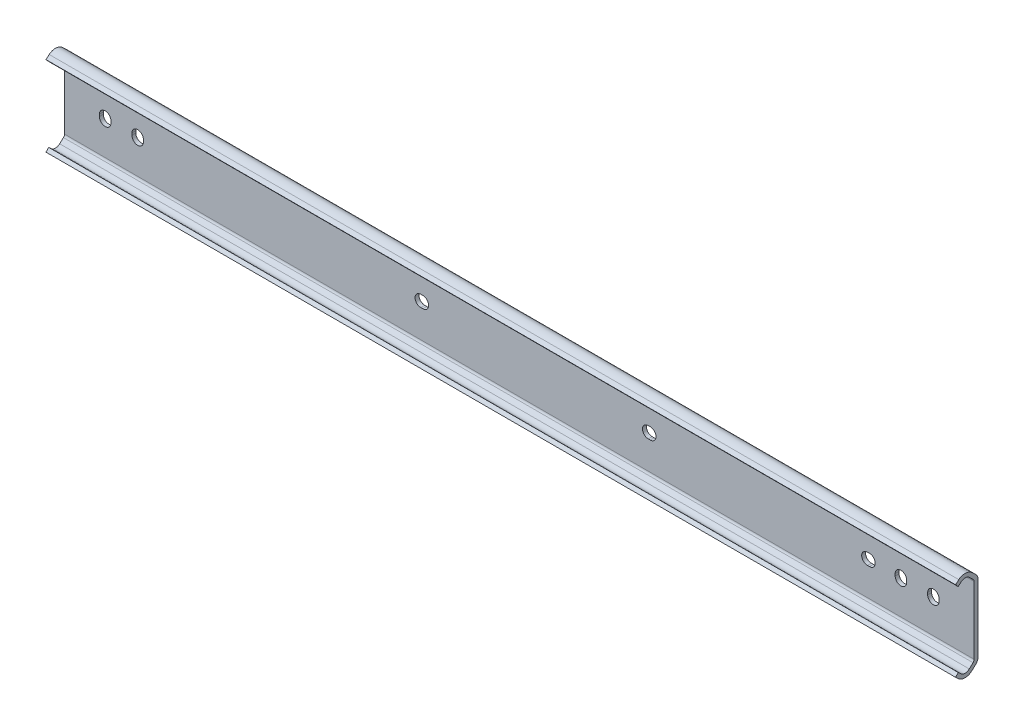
ISO-10303-21;
HEADER;
FILE_DESCRIPTION(('STEP AP214'),'2;1');
FILE_NAME('part.step','',(''),(''),'','','');
FILE_SCHEMA(('AUTOMOTIVE_DESIGN { 1 0 10303 214 1 1 1 1 }'));
ENDSEC;
DATA;
#1=APPLICATION_CONTEXT('core data for automotive mechanical design processes');
#2=APPLICATION_PROTOCOL_DEFINITION('international standard','automotive_design',2000,#1);
#3=PRODUCT_CONTEXT('',#1,'mechanical');
#4=PRODUCT('Part','Part','',(#3));
#5=PRODUCT_RELATED_PRODUCT_CATEGORY('part','',(#4));
#6=PRODUCT_DEFINITION_FORMATION('','',#4);
#7=PRODUCT_DEFINITION_CONTEXT('part definition',#1,'design');
#8=PRODUCT_DEFINITION('design','',#6,#7);
#9=PRODUCT_DEFINITION_SHAPE('','',#8);
#10=(LENGTH_UNIT() NAMED_UNIT(*) SI_UNIT(.MILLI.,.METRE.));
#11=(NAMED_UNIT(*) PLANE_ANGLE_UNIT() SI_UNIT($,.RADIAN.));
#12=(NAMED_UNIT(*) SI_UNIT($,.STERADIAN.) SOLID_ANGLE_UNIT());
#13=UNCERTAINTY_MEASURE_WITH_UNIT(LENGTH_MEASURE(1.E-05),#10,'distance_accuracy_value','');
#14=(GEOMETRIC_REPRESENTATION_CONTEXT(3) GLOBAL_UNCERTAINTY_ASSIGNED_CONTEXT((#13)) GLOBAL_UNIT_ASSIGNED_CONTEXT((#10,
#11,#12)) REPRESENTATION_CONTEXT('',''));
#15=CARTESIAN_POINT('',(0.,0.,0.));
#16=DIRECTION('',(0.,0.,1.));
#17=DIRECTION('',(1.,0.,0.));
#18=AXIS2_PLACEMENT_3D('',#15,#16,#17);
#19=CARTESIAN_POINT('',(-15.9,13.1771270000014,1.52400011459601));
#20=DIRECTION('',(0.,0.,1.));
#21=DIRECTION('',(-1.,0.,0.));
#22=AXIS2_PLACEMENT_3D('',#19,#20,#21);
#23=PLANE('',#22);
#24=DIRECTION('',(0.,-1.,0.));
#25=VECTOR('',#24,1.);
#26=CARTESIAN_POINT('',(-15.9,13.1771270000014,1.52400011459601));
#27=LINE('',#26,#25);
#28=CARTESIAN_POINT('',(-15.9,13.1771270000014,1.52400011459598));
#29=VERTEX_POINT('',#28);
#30=CARTESIAN_POINT('',(-15.9,-13.1771270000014,1.52400011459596));
#31=VERTEX_POINT('',#30);
#32=EDGE_CURVE('E686',#29,#31,#27,.T.);
#33=ORIENTED_EDGE('',*,*,#32,.T.);
#34=DIRECTION('',(-1.,0.,0.));
#35=VECTOR('',#34,1.);
#36=CARTESIAN_POINT('',(339.7,-13.1771270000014,1.52400011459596));
#37=LINE('',#36,#35);
#38=CARTESIAN_POINT('',(339.7,-13.1771270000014,1.52400011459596));
#39=VERTEX_POINT('',#38);
#40=EDGE_CURVE('E393',#39,#31,#37,.T.);
#41=ORIENTED_EDGE('',*,*,#40,.F.);
#42=DIRECTION('',(0.,-1.,0.));
#43=VECTOR('',#42,1.);
#44=CARTESIAN_POINT('',(339.7,13.1771270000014,1.52400011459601));
#45=LINE('',#44,#43);
#46=CARTESIAN_POINT('',(339.7,13.1771270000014,1.52400011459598));
#47=VERTEX_POINT('',#46);
#48=EDGE_CURVE('E656',#47,#39,#45,.T.);
#49=ORIENTED_EDGE('',*,*,#48,.F.);
#50=DIRECTION('',(1.,0.,0.));
#51=VECTOR('',#50,1.);
#52=CARTESIAN_POINT('',(-15.9,13.1771270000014,1.52400011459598));
#53=LINE('',#52,#51);
#54=EDGE_CURVE('E9',#29,#47,#53,.T.);
#55=ORIENTED_EDGE('',*,*,#54,.F.);
#56=EDGE_LOOP('',(#33,#41,#49,#55));
#57=FACE_BOUND('',#56,.T.);
#58=CARTESIAN_POINT('',(124.2,0.,1.52400011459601));
#59=DIRECTION('',(0.,0.,1.));
#60=DIRECTION('',(-1.,0.,0.));
#61=AXIS2_PLACEMENT_3D('',#58,#59,#60);
#62=CIRCLE('',#61,2.25);
#63=CARTESIAN_POINT('',(124.2,-2.25,1.52400011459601));
#64=VERTEX_POINT('',#63);
#65=CARTESIAN_POINT('',(124.2,2.25,1.52400011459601));
#66=VERTEX_POINT('',#65);
#67=EDGE_CURVE('E31',#64,#66,#62,.T.);
#68=ORIENTED_EDGE('',*,*,#67,.F.);
#69=DIRECTION('',(1.,0.,0.));
#70=VECTOR('',#69,1.);
#71=CARTESIAN_POINT('',(124.2,-2.25,1.52400011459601));
#72=LINE('',#71,#70);
#73=CARTESIAN_POINT('',(123.4,-2.25,1.52400011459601));
#74=VERTEX_POINT('',#73);
#75=EDGE_CURVE('E423',#74,#64,#72,.T.);
#76=ORIENTED_EDGE('',*,*,#75,.F.);
#77=CARTESIAN_POINT('',(123.4,0.,1.52400011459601));
#78=DIRECTION('',(0.,0.,1.));
#79=DIRECTION('',(-1.,0.,0.));
#80=AXIS2_PLACEMENT_3D('',#77,#78,#79);
#81=CIRCLE('',#80,2.25);
#82=CARTESIAN_POINT('',(123.4,2.25,1.52400011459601));
#83=VERTEX_POINT('',#82);
#84=EDGE_CURVE('E420',#83,#74,#81,.T.);
#85=ORIENTED_EDGE('',*,*,#84,.F.);
#86=DIRECTION('',(-1.,0.,0.));
#87=VECTOR('',#86,1.);
#88=CARTESIAN_POINT('',(124.2,2.25,1.52400011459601));
#89=LINE('',#88,#87);
#90=EDGE_CURVE('E418',#66,#83,#89,.T.);
#91=ORIENTED_EDGE('',*,*,#90,.F.);
#92=EDGE_LOOP('',(#68,#76,#85,#91));
#93=FACE_BOUND('',#92,.T.);
#94=CARTESIAN_POINT('',(213.1,0.,1.52400011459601));
#95=DIRECTION('',(0.,0.,1.));
#96=DIRECTION('',(-1.,0.,0.));
#97=AXIS2_PLACEMENT_3D('',#94,#95,#96);
#98=CIRCLE('',#97,2.25);
#99=CARTESIAN_POINT('',(213.1,-2.25,1.52400011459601));
#100=VERTEX_POINT('',#99);
#101=CARTESIAN_POINT('',(213.1,2.25,1.52400011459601));
#102=VERTEX_POINT('',#101);
#103=EDGE_CURVE('E445',#100,#102,#98,.T.);
#104=ORIENTED_EDGE('',*,*,#103,.F.);
#105=DIRECTION('',(1.,0.,0.));
#106=VECTOR('',#105,1.);
#107=CARTESIAN_POINT('',(213.1,-2.25,1.52400011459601));
#108=LINE('',#107,#106);
#109=CARTESIAN_POINT('',(212.3,-2.25,1.52400011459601));
#110=VERTEX_POINT('',#109);
#111=EDGE_CURVE('E453',#110,#100,#108,.T.);
#112=ORIENTED_EDGE('',*,*,#111,.F.);
#113=CARTESIAN_POINT('',(212.3,0.,1.52400011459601));
#114=DIRECTION('',(0.,0.,1.));
#115=DIRECTION('',(-1.,0.,0.));
#116=AXIS2_PLACEMENT_3D('',#113,#114,#115);
#117=CIRCLE('',#116,2.25);
#118=CARTESIAN_POINT('',(212.3,2.25,1.52400011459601));
#119=VERTEX_POINT('',#118);
#120=EDGE_CURVE('E450',#119,#110,#117,.T.);
#121=ORIENTED_EDGE('',*,*,#120,.F.);
#122=DIRECTION('',(-1.,0.,0.));
#123=VECTOR('',#122,1.);
#124=CARTESIAN_POINT('',(213.1,2.25,1.52400011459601));
#125=LINE('',#124,#123);
#126=EDGE_CURVE('E447',#102,#119,#125,.T.);
#127=ORIENTED_EDGE('',*,*,#126,.F.);
#128=EDGE_LOOP('',(#104,#112,#121,#127));
#129=FACE_BOUND('',#128,.T.);
#130=CARTESIAN_POINT('',(0.,-0.4,1.52400011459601));
#131=DIRECTION('',(0.,0.,1.));
#132=DIRECTION('',(-1.,0.,0.));
#133=AXIS2_PLACEMENT_3D('',#130,#131,#132);
#134=CIRCLE('',#133,2.25);
#135=CARTESIAN_POINT('',(-2.24999999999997,-0.4,1.52400011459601));
#136=VERTEX_POINT('',#135);
#137=CARTESIAN_POINT('',(2.24999999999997,-0.4,1.52400011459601));
#138=VERTEX_POINT('',#137);
#139=EDGE_CURVE('E477',#136,#138,#134,.T.);
#140=ORIENTED_EDGE('',*,*,#139,.F.);
#141=DIRECTION('',(0.,-1.,0.));
#142=VECTOR('',#141,1.);
#143=CARTESIAN_POINT('',(-2.24999999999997,-0.4,1.52400011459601));
#144=LINE('',#143,#142);
#145=CARTESIAN_POINT('',(-2.24999999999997,0.4,1.52400011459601));
#146=VERTEX_POINT('',#145);
#147=EDGE_CURVE('E485',#146,#136,#144,.T.);
#148=ORIENTED_EDGE('',*,*,#147,.F.);
#149=CARTESIAN_POINT('',(0.,0.4,1.52400011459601));
#150=DIRECTION('',(0.,0.,1.));
#151=DIRECTION('',(-1.,0.,0.));
#152=AXIS2_PLACEMENT_3D('',#149,#150,#151);
#153=CIRCLE('',#152,2.25);
#154=CARTESIAN_POINT('',(2.24999999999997,0.4,1.52400011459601));
#155=VERTEX_POINT('',#154);
#156=EDGE_CURVE('E482',#155,#146,#153,.T.);
#157=ORIENTED_EDGE('',*,*,#156,.F.);
#158=DIRECTION('',(0.,1.,0.));
#159=VECTOR('',#158,1.);
#160=CARTESIAN_POINT('',(2.24999999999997,0.4,1.52400011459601));
#161=LINE('',#160,#159);
#162=EDGE_CURVE('E479',#138,#155,#161,.T.);
#163=ORIENTED_EDGE('',*,*,#162,.F.);
#164=EDGE_LOOP('',(#140,#148,#157,#163));
#165=FACE_BOUND('',#164,.T.);
#166=CARTESIAN_POINT('',(12.7,-0.4,1.52400011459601));
#167=DIRECTION('',(0.,0.,1.));
#168=DIRECTION('',(-1.,0.,0.));
#169=AXIS2_PLACEMENT_3D('',#166,#167,#168);
#170=CIRCLE('',#169,2.25);
#171=CARTESIAN_POINT('',(10.45,-0.4,1.52400011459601));
#172=VERTEX_POINT('',#171);
#173=CARTESIAN_POINT('',(14.95,-0.4,1.52400011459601));
#174=VERTEX_POINT('',#173);
#175=EDGE_CURVE('E509',#172,#174,#170,.T.);
#176=ORIENTED_EDGE('',*,*,#175,.F.);
#177=DIRECTION('',(0.,-1.,0.));
#178=VECTOR('',#177,1.);
#179=CARTESIAN_POINT('',(10.45,-0.4,1.52400011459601));
#180=LINE('',#179,#178);
#181=CARTESIAN_POINT('',(10.45,0.4,1.52400011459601));
#182=VERTEX_POINT('',#181);
#183=EDGE_CURVE('E517',#182,#172,#180,.T.);
#184=ORIENTED_EDGE('',*,*,#183,.F.);
#185=CARTESIAN_POINT('',(12.7,0.4,1.52400011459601));
#186=DIRECTION('',(0.,0.,1.));
#187=DIRECTION('',(-1.,0.,0.));
#188=AXIS2_PLACEMENT_3D('',#185,#186,#187);
#189=CIRCLE('',#188,2.25);
#190=CARTESIAN_POINT('',(14.95,0.4,1.52400011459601));
#191=VERTEX_POINT('',#190);
#192=EDGE_CURVE('E514',#191,#182,#189,.T.);
#193=ORIENTED_EDGE('',*,*,#192,.F.);
#194=DIRECTION('',(0.,1.,0.));
#195=VECTOR('',#194,1.);
#196=CARTESIAN_POINT('',(14.95,0.4,1.52400011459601));
#197=LINE('',#196,#195);
#198=EDGE_CURVE('E511',#174,#191,#197,.T.);
#199=ORIENTED_EDGE('',*,*,#198,.F.);
#200=EDGE_LOOP('',(#176,#184,#193,#199));
#201=FACE_BOUND('',#200,.T.);
#202=CARTESIAN_POINT('',(311.1,-0.4,1.52400011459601));
#203=DIRECTION('',(0.,0.,1.));
#204=DIRECTION('',(-1.,0.,0.));
#205=AXIS2_PLACEMENT_3D('',#202,#203,#204);
#206=CIRCLE('',#205,2.25);
#207=CARTESIAN_POINT('',(308.85,-0.4,1.52400011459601));
#208=VERTEX_POINT('',#207);
#209=CARTESIAN_POINT('',(313.35,-0.4,1.52400011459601));
#210=VERTEX_POINT('',#209);
#211=EDGE_CURVE('E541',#208,#210,#206,.T.);
#212=ORIENTED_EDGE('',*,*,#211,.F.);
#213=DIRECTION('',(0.,-1.,0.));
#214=VECTOR('',#213,1.);
#215=CARTESIAN_POINT('',(308.85,-0.4,1.52400011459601));
#216=LINE('',#215,#214);
#217=CARTESIAN_POINT('',(308.85,0.4,1.52400011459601));
#218=VERTEX_POINT('',#217);
#219=EDGE_CURVE('E549',#218,#208,#216,.T.);
#220=ORIENTED_EDGE('',*,*,#219,.F.);
#221=CARTESIAN_POINT('',(311.1,0.4,1.52400011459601));
#222=DIRECTION('',(0.,0.,1.));
#223=DIRECTION('',(-1.,0.,0.));
#224=AXIS2_PLACEMENT_3D('',#221,#222,#223);
#225=CIRCLE('',#224,2.25);
#226=CARTESIAN_POINT('',(313.35,0.4,1.52400011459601));
#227=VERTEX_POINT('',#226);
#228=EDGE_CURVE('E546',#227,#218,#225,.T.);
#229=ORIENTED_EDGE('',*,*,#228,.F.);
#230=DIRECTION('',(0.,1.,0.));
#231=VECTOR('',#230,1.);
#232=CARTESIAN_POINT('',(313.35,0.4,1.52400011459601));
#233=LINE('',#232,#231);
#234=EDGE_CURVE('E543',#210,#227,#233,.T.);
#235=ORIENTED_EDGE('',*,*,#234,.F.);
#236=EDGE_LOOP('',(#212,#220,#229,#235));
#237=FACE_BOUND('',#236,.T.);
#238=CARTESIAN_POINT('',(298.8,0.,1.52400011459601));
#239=DIRECTION('',(0.,0.,1.));
#240=DIRECTION('',(-1.,0.,0.));
#241=AXIS2_PLACEMENT_3D('',#238,#239,#240);
#242=CIRCLE('',#241,2.25);
#243=CARTESIAN_POINT('',(298.8,-2.25,1.52400011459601));
#244=VERTEX_POINT('',#243);
#245=CARTESIAN_POINT('',(298.8,2.25,1.52400011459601));
#246=VERTEX_POINT('',#245);
#247=EDGE_CURVE('E573',#244,#246,#242,.T.);
#248=ORIENTED_EDGE('',*,*,#247,.F.);
#249=DIRECTION('',(1.,0.,0.));
#250=VECTOR('',#249,1.);
#251=CARTESIAN_POINT('',(298.8,-2.25,1.52400011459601));
#252=LINE('',#251,#250);
#253=CARTESIAN_POINT('',(298.,-2.25,1.52400011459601));
#254=VERTEX_POINT('',#253);
#255=EDGE_CURVE('E581',#254,#244,#252,.T.);
#256=ORIENTED_EDGE('',*,*,#255,.F.);
#257=CARTESIAN_POINT('',(298.,0.,1.52400011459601));
#258=DIRECTION('',(0.,0.,1.));
#259=DIRECTION('',(-1.,0.,0.));
#260=AXIS2_PLACEMENT_3D('',#257,#258,#259);
#261=CIRCLE('',#260,2.25);
#262=CARTESIAN_POINT('',(298.,2.25,1.52400011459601));
#263=VERTEX_POINT('',#262);
#264=EDGE_CURVE('E578',#263,#254,#261,.T.);
#265=ORIENTED_EDGE('',*,*,#264,.F.);
#266=DIRECTION('',(-1.,0.,0.));
#267=VECTOR('',#266,1.);
#268=CARTESIAN_POINT('',(298.8,2.25,1.52400011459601));
#269=LINE('',#268,#267);
#270=EDGE_CURVE('E575',#246,#263,#269,.T.);
#271=ORIENTED_EDGE('',*,*,#270,.F.);
#272=EDGE_LOOP('',(#248,#256,#265,#271));
#273=FACE_BOUND('',#272,.T.);
#274=CARTESIAN_POINT('',(323.8,-0.4,1.52400011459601));
#275=DIRECTION('',(0.,0.,1.));
#276=DIRECTION('',(-1.,0.,0.));
#277=AXIS2_PLACEMENT_3D('',#274,#275,#276);
#278=CIRCLE('',#277,2.25);
#279=CARTESIAN_POINT('',(321.55,-0.4,1.52400011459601));
#280=VERTEX_POINT('',#279);
#281=CARTESIAN_POINT('',(326.05,-0.4,1.52400011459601));
#282=VERTEX_POINT('',#281);
#283=EDGE_CURVE('E605',#280,#282,#278,.T.);
#284=ORIENTED_EDGE('',*,*,#283,.F.);
#285=DIRECTION('',(0.,-1.,0.));
#286=VECTOR('',#285,1.);
#287=CARTESIAN_POINT('',(321.55,-0.4,1.52400011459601));
#288=LINE('',#287,#286);
#289=CARTESIAN_POINT('',(321.55,0.4,1.52400011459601));
#290=VERTEX_POINT('',#289);
#291=EDGE_CURVE('E613',#290,#280,#288,.T.);
#292=ORIENTED_EDGE('',*,*,#291,.F.);
#293=CARTESIAN_POINT('',(323.8,0.4,1.52400011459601));
#294=DIRECTION('',(0.,0.,1.));
#295=DIRECTION('',(-1.,0.,0.));
#296=AXIS2_PLACEMENT_3D('',#293,#294,#295);
#297=CIRCLE('',#296,2.25);
#298=CARTESIAN_POINT('',(326.05,0.4,1.52400011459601));
#299=VERTEX_POINT('',#298);
#300=EDGE_CURVE('E610',#299,#290,#297,.T.);
#301=ORIENTED_EDGE('',*,*,#300,.F.);
#302=DIRECTION('',(0.,1.,0.));
#303=VECTOR('',#302,1.);
#304=CARTESIAN_POINT('',(326.05,0.4,1.52400011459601));
#305=LINE('',#304,#303);
#306=EDGE_CURVE('E607',#282,#299,#305,.T.);
#307=ORIENTED_EDGE('',*,*,#306,.F.);
#308=EDGE_LOOP('',(#284,#292,#301,#307));
#309=FACE_BOUND('',#308,.T.);
#310=ADVANCED_FACE('F14',(#57,#93,#129,#165,#201,#237,#273,#309),#23,.T.);
#311=CARTESIAN_POINT('',(-15.9,13.1771270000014,2.82399974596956));
#312=DIRECTION('',(1.,0.,0.));
#313=DIRECTION('',(0.,0.,1.));
#314=AXIS2_PLACEMENT_3D('',#311,#312,#313);
#315=CYLINDRICAL_SURFACE('',#314,1.29999963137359);
#316=CARTESIAN_POINT('',(339.7,13.1771270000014,2.82399974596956));
#317=DIRECTION('',(-1.,0.,0.));
#318=DIRECTION('',(0.,0.,-1.));
#319=AXIS2_PLACEMENT_3D('',#316,#317,#318);
#320=CIRCLE('',#319,1.29999963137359);
#321=CARTESIAN_POINT('',(339.7,14.1308812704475,1.94062449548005));
#322=VERTEX_POINT('',#321);
#323=EDGE_CURVE('E653',#322,#47,#320,.T.);
#324=ORIENTED_EDGE('',*,*,#323,.F.);
#325=DIRECTION('',(1.,0.,0.));
#326=VECTOR('',#325,1.);
#327=CARTESIAN_POINT('',(-15.9,14.1308812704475,1.94062449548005));
#328=LINE('',#327,#326);
#329=CARTESIAN_POINT('',(-15.9,14.1308812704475,1.94062449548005));
#330=VERTEX_POINT('',#329);
#331=EDGE_CURVE('E23',#330,#322,#328,.T.);
#332=ORIENTED_EDGE('',*,*,#331,.F.);
#333=CARTESIAN_POINT('',(-15.9,13.1771270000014,2.82399974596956));
#334=DIRECTION('',(-1.,0.,0.));
#335=DIRECTION('',(0.,0.,-1.));
#336=AXIS2_PLACEMENT_3D('',#333,#334,#335);
#337=CIRCLE('',#336,1.29999963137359);
#338=EDGE_CURVE('E683',#330,#29,#337,.T.);
#339=ORIENTED_EDGE('',*,*,#338,.T.);
#340=ORIENTED_EDGE('',*,*,#54,.T.);
#341=EDGE_LOOP('',(#324,#332,#339,#340));
#342=FACE_BOUND('',#341,.T.);
#343=ADVANCED_FACE('F742',(#342),#315,.F.);
#344=CARTESIAN_POINT('',(-15.9,15.4973237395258,3.41593142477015));
#345=DIRECTION('',(0.,-0.733657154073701,0.679519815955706));
#346=DIRECTION('',(0.,-0.679519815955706,-0.733657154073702));
#347=AXIS2_PLACEMENT_3D('',#344,#345,#346);
#348=PLANE('',#347);
#349=DIRECTION('',(0.,-0.679519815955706,-0.733657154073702));
#350=VECTOR('',#349,1.);
#351=CARTESIAN_POINT('',(339.7,15.4973237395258,3.41593142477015));
#352=LINE('',#351,#350);
#353=CARTESIAN_POINT('',(339.7,15.4973237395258,3.41593142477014));
#354=VERTEX_POINT('',#353);
#355=EDGE_CURVE('E650',#354,#322,#352,.T.);
#356=ORIENTED_EDGE('',*,*,#355,.F.);
#357=DIRECTION('',(1.,0.,0.));
#358=VECTOR('',#357,1.);
#359=CARTESIAN_POINT('',(-15.9,15.4973237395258,3.41593142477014));
#360=LINE('',#359,#358);
#361=CARTESIAN_POINT('',(-15.9,15.4973237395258,3.41593142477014));
#362=VERTEX_POINT('',#361);
#363=EDGE_CURVE('E689',#362,#354,#360,.T.);
#364=ORIENTED_EDGE('',*,*,#363,.F.);
#365=DIRECTION('',(0.,-0.679519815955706,-0.733657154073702));
#366=VECTOR('',#365,1.);
#367=CARTESIAN_POINT('',(-15.9,15.4973237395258,3.41593142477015));
#368=LINE('',#367,#366);
#369=EDGE_CURVE('E680',#362,#330,#368,.T.);
#370=ORIENTED_EDGE('',*,*,#369,.T.);
#371=ORIENTED_EDGE('',*,*,#331,.T.);
#372=EDGE_LOOP('',(#356,#364,#370,#371));
#373=FACE_BOUND('',#372,.T.);
#374=ADVANCED_FACE('F738',(#373),#348,.T.);
#375=CARTESIAN_POINT('',(-15.9,13.745000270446,5.04999949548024));
#376=DIRECTION('',(1.,0.,0.));
#377=DIRECTION('',(0.,0.,1.));
#378=AXIS2_PLACEMENT_3D('',#375,#376,#377);
#379=CYLINDRICAL_SURFACE('',#378,2.39600000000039);
#380=CARTESIAN_POINT('',(339.7,13.745000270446,5.04999949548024));
#381=DIRECTION('',(-1.,0.,0.));
#382=DIRECTION('',(0.,0.,-1.));
#383=AXIS2_PLACEMENT_3D('',#380,#381,#382);
#384=CIRCLE('',#383,2.39600000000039);
#385=CARTESIAN_POINT('',(339.7,15.4018251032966,6.78082226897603));
#386=VERTEX_POINT('',#385);
#387=EDGE_CURVE('E647',#386,#354,#384,.T.);
#388=ORIENTED_EDGE('',*,*,#387,.F.);
#389=DIRECTION('',(1.,0.,0.));
#390=VECTOR('',#389,1.);
#391=CARTESIAN_POINT('',(-15.9,15.4018251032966,6.78082226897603));
#392=LINE('',#391,#390);
#393=CARTESIAN_POINT('',(-15.9,15.4018251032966,6.78082226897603));
#394=VERTEX_POINT('',#393);
#395=EDGE_CURVE('E691',#394,#386,#392,.T.);
#396=ORIENTED_EDGE('',*,*,#395,.F.);
#397=CARTESIAN_POINT('',(-15.9,13.745000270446,5.04999949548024));
#398=DIRECTION('',(-1.,0.,0.));
#399=DIRECTION('',(0.,0.,-1.));
#400=AXIS2_PLACEMENT_3D('',#397,#398,#399);
#401=CIRCLE('',#400,2.39600000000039);
#402=EDGE_CURVE('E677',#394,#362,#401,.T.);
#403=ORIENTED_EDGE('',*,*,#402,.T.);
#404=ORIENTED_EDGE('',*,*,#363,.T.);
#405=EDGE_LOOP('',(#388,#396,#403,#404));
#406=FACE_BOUND('',#405,.T.);
#407=ADVANCED_FACE('F734',(#406),#379,.F.);
#408=CARTESIAN_POINT('',(-15.9,15.4018251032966,6.78082226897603));
#409=DIRECTION('',(0.,-0.741021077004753,-0.671481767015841));
#410=DIRECTION('',(0.,0.671481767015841,-0.741021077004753));
#411=AXIS2_PLACEMENT_3D('',#408,#409,#410);
#412=PLANE('',#411);
#413=DIRECTION('',(0.,0.671481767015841,-0.741021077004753));
#414=VECTOR('',#413,1.);
#415=CARTESIAN_POINT('',(339.7,15.4018251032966,6.78082226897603));
#416=LINE('',#415,#414);
#417=CARTESIAN_POINT('',(339.7,14.5356842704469,7.73666149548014));
#418=VERTEX_POINT('',#417);
#419=EDGE_CURVE('E644',#418,#386,#416,.T.);
#420=ORIENTED_EDGE('',*,*,#419,.F.);
#421=DIRECTION('',(1.,0.,0.));
#422=VECTOR('',#421,1.);
#423=CARTESIAN_POINT('',(-15.9,14.5356842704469,7.73666149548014));
#424=LINE('',#423,#422);
#425=CARTESIAN_POINT('',(-15.9,14.5356842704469,7.73666149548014));
#426=VERTEX_POINT('',#425);
#427=EDGE_CURVE('E693',#426,#418,#424,.T.);
#428=ORIENTED_EDGE('',*,*,#427,.F.);
#429=DIRECTION('',(0.,0.671481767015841,-0.741021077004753));
#430=VECTOR('',#429,1.);
#431=CARTESIAN_POINT('',(-15.9,15.4018251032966,6.78082226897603));
#432=LINE('',#431,#430);
#433=EDGE_CURVE('E674',#426,#394,#432,.T.);
#434=ORIENTED_EDGE('',*,*,#433,.T.);
#435=ORIENTED_EDGE('',*,*,#395,.T.);
#436=EDGE_LOOP('',(#420,#428,#434,#435));
#437=FACE_BOUND('',#436,.T.);
#438=ADVANCED_FACE('F730',(#437),#412,.T.);
#439=CARTESIAN_POINT('',(-15.9,14.5356842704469,7.73666149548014));
#440=DIRECTION('',(0.,-0.671481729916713,0.741021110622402));
#441=DIRECTION('',(0.,-0.741021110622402,-0.671481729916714));
#442=AXIS2_PLACEMENT_3D('',#439,#440,#441);
#443=PLANE('',#442);
#444=DIRECTION('',(0.,-0.741021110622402,-0.671481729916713));
#445=VECTOR('',#444,1.);
#446=CARTESIAN_POINT('',(339.7,14.5356842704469,7.73666149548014));
#447=LINE('',#446,#445);
#448=CARTESIAN_POINT('',(339.7,15.6649899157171,8.75999011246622));
#449=VERTEX_POINT('',#448);
#450=EDGE_CURVE('E641',#449,#418,#447,.T.);
#451=ORIENTED_EDGE('',*,*,#450,.F.);
#452=DIRECTION('',(1.,0.,0.));
#453=VECTOR('',#452,1.);
#454=CARTESIAN_POINT('',(-15.9,15.6649899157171,8.75999011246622));
#455=LINE('',#454,#453);
#456=CARTESIAN_POINT('',(-15.9,15.6649899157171,8.75999011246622));
#457=VERTEX_POINT('',#456);
#458=EDGE_CURVE('E695',#457,#449,#455,.T.);
#459=ORIENTED_EDGE('',*,*,#458,.F.);
#460=DIRECTION('',(0.,-0.741021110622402,-0.671481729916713));
#461=VECTOR('',#460,1.);
#462=CARTESIAN_POINT('',(-15.9,14.5356842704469,7.73666149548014));
#463=LINE('',#462,#461);
#464=EDGE_CURVE('E671',#457,#426,#463,.T.);
#465=ORIENTED_EDGE('',*,*,#464,.T.);
#466=ORIENTED_EDGE('',*,*,#427,.T.);
#467=EDGE_LOOP('',(#451,#459,#465,#466));
#468=FACE_BOUND('',#467,.T.);
#469=ADVANCED_FACE('F726',(#468),#443,.T.);
#470=CARTESIAN_POINT('',(-15.9,16.7914015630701,7.51692662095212));
#471=DIRECTION('',(0.,0.741020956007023,0.67148190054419));
#472=DIRECTION('',(0.,-0.671481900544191,0.741020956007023));
#473=AXIS2_PLACEMENT_3D('',#470,#471,#472);
#474=PLANE('',#473);
#475=DIRECTION('',(0.,-0.671481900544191,0.741020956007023));
#476=VECTOR('',#475,1.);
#477=CARTESIAN_POINT('',(339.7,16.7914015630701,7.51692662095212));
#478=LINE('',#477,#476);
#479=CARTESIAN_POINT('',(339.7,16.7914015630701,7.5169266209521));
#480=VERTEX_POINT('',#479);
#481=EDGE_CURVE('E638',#480,#449,#478,.T.);
#482=ORIENTED_EDGE('',*,*,#481,.F.);
#483=DIRECTION('',(1.,0.,0.));
#484=VECTOR('',#483,1.);
#485=CARTESIAN_POINT('',(-15.9,16.7914015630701,7.5169266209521));
#486=LINE('',#485,#484);
#487=CARTESIAN_POINT('',(-15.9,16.7914015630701,7.5169266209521));
#488=VERTEX_POINT('',#487);
#489=EDGE_CURVE('E697',#488,#480,#486,.T.);
#490=ORIENTED_EDGE('',*,*,#489,.F.);
#491=DIRECTION('',(0.,-0.671481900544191,0.741020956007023));
#492=VECTOR('',#491,1.);
#493=CARTESIAN_POINT('',(-15.9,16.7914015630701,7.51692662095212));
#494=LINE('',#493,#492);
#495=EDGE_CURVE('E668',#488,#457,#494,.T.);
#496=ORIENTED_EDGE('',*,*,#495,.T.);
#497=ORIENTED_EDGE('',*,*,#458,.T.);
#498=EDGE_LOOP('',(#482,#490,#496,#497));
#499=FACE_BOUND('',#498,.T.);
#500=ADVANCED_FACE('F722',(#499),#474,.T.);
#501=CARTESIAN_POINT('',(-15.9,13.745000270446,5.04999949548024));
#502=DIRECTION('',(1.,0.,0.));
#503=DIRECTION('',(0.,0.,1.));
#504=AXIS2_PLACEMENT_3D('',#501,#502,#503);
#505=CYLINDRICAL_SURFACE('',#504,3.91998600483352);
#506=CARTESIAN_POINT('',(339.7,13.745000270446,5.04999949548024));
#507=DIRECTION('',(1.,0.,0.));
#508=DIRECTION('',(0.,0.,-1.));
#509=AXIS2_PLACEMENT_3D('',#506,#507,#508);
#510=CIRCLE('',#509,3.91998600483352);
#511=CARTESIAN_POINT('',(339.7,16.620926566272,2.38629188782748));
#512=VERTEX_POINT('',#511);
#513=EDGE_CURVE('E635',#512,#480,#510,.T.);
#514=ORIENTED_EDGE('',*,*,#513,.F.);
#515=DIRECTION('',(1.,0.,0.));
#516=VECTOR('',#515,1.);
#517=CARTESIAN_POINT('',(-15.9,16.620926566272,2.38629188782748));
#518=LINE('',#517,#516);
#519=CARTESIAN_POINT('',(-15.9,16.620926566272,2.38629188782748));
#520=VERTEX_POINT('',#519);
#521=EDGE_CURVE('E699',#520,#512,#518,.T.);
#522=ORIENTED_EDGE('',*,*,#521,.F.);
#523=CARTESIAN_POINT('',(-15.9,13.745000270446,5.04999949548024));
#524=DIRECTION('',(1.,0.,0.));
#525=DIRECTION('',(0.,0.,-1.));
#526=AXIS2_PLACEMENT_3D('',#523,#524,#525);
#527=CIRCLE('',#526,3.91998600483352);
#528=EDGE_CURVE('E665',#520,#488,#527,.T.);
#529=ORIENTED_EDGE('',*,*,#528,.T.);
#530=ORIENTED_EDGE('',*,*,#489,.T.);
#531=EDGE_LOOP('',(#514,#522,#529,#530));
#532=FACE_BOUND('',#531,.T.);
#533=ADVANCED_FACE('F718',(#532),#505,.T.);
#534=CARTESIAN_POINT('',(-15.9,16.620926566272,2.38629188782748));
#535=DIRECTION('',(0.,0.73365728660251,-0.679519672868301));
#536=DIRECTION('',(0.,0.679519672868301,0.73365728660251));
#537=AXIS2_PLACEMENT_3D('',#534,#535,#536);
#538=PLANE('',#537);
#539=DIRECTION('',(0.,0.679519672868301,0.73365728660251));
#540=VECTOR('',#539,1.);
#541=CARTESIAN_POINT('',(339.7,16.620926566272,2.38629188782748));
#542=LINE('',#541,#540);
#543=CARTESIAN_POINT('',(339.7,15.2489749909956,0.90503636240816));
#544=VERTEX_POINT('',#543);
#545=EDGE_CURVE('E633',#544,#512,#542,.T.);
#546=ORIENTED_EDGE('',*,*,#545,.F.);
#547=DIRECTION('',(1.,0.,0.));
#548=VECTOR('',#547,1.);
#549=CARTESIAN_POINT('',(-15.9,15.2489749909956,0.90503636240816));
#550=LINE('',#549,#548);
#551=CARTESIAN_POINT('',(-15.9,15.2489749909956,0.90503636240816));
#552=VERTEX_POINT('',#551);
#553=EDGE_CURVE('E701',#552,#544,#550,.T.);
#554=ORIENTED_EDGE('',*,*,#553,.F.);
#555=DIRECTION('',(0.,0.679519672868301,0.73365728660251));
#556=VECTOR('',#555,1.);
#557=CARTESIAN_POINT('',(-15.9,16.620926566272,2.38629188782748));
#558=LINE('',#557,#556);
#559=EDGE_CURVE('E663',#552,#520,#558,.T.);
#560=ORIENTED_EDGE('',*,*,#559,.T.);
#561=ORIENTED_EDGE('',*,*,#521,.T.);
#562=EDGE_LOOP('',(#546,#554,#560,#561));
#563=FACE_BOUND('',#562,.T.);
#564=ADVANCED_FACE('F714',(#563),#538,.T.);
#565=CARTESIAN_POINT('',(-15.9,13.1771270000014,2.82399974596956));
#566=DIRECTION('',(1.,0.,0.));
#567=DIRECTION('',(0.,0.,1.));
#568=AXIS2_PLACEMENT_3D('',#565,#566,#567);
#569=CYLINDRICAL_SURFACE('',#568,2.82399974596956);
#570=CARTESIAN_POINT('',(339.7,13.1771270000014,2.82399974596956));
#571=DIRECTION('',(1.,0.,0.));
#572=DIRECTION('',(0.,0.,-1.));
#573=AXIS2_PLACEMENT_3D('',#570,#571,#572);
#574=CIRCLE('',#573,2.82399974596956);
#575=CARTESIAN_POINT('',(339.7,13.1771270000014,0.));
#576=VERTEX_POINT('',#575);
#577=EDGE_CURVE('E630',#576,#544,#574,.T.);
#578=ORIENTED_EDGE('',*,*,#577,.F.);
#579=DIRECTION('',(1.,0.,0.));
#580=VECTOR('',#579,1.);
#581=CARTESIAN_POINT('',(-15.9,13.1771270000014,0.));
#582=LINE('',#581,#580);
#583=CARTESIAN_POINT('',(-15.9,13.1771270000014,0.));
#584=VERTEX_POINT('',#583);
#585=EDGE_CURVE('E18',#584,#576,#582,.T.);
#586=ORIENTED_EDGE('',*,*,#585,.F.);
#587=CARTESIAN_POINT('',(-15.9,13.1771270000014,2.82399974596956));
#588=DIRECTION('',(1.,0.,0.));
#589=DIRECTION('',(0.,0.,-1.));
#590=AXIS2_PLACEMENT_3D('',#587,#588,#589);
#591=CIRCLE('',#590,2.82399974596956);
#592=EDGE_CURVE('E660',#584,#552,#591,.T.);
#593=ORIENTED_EDGE('',*,*,#592,.T.);
#594=ORIENTED_EDGE('',*,*,#553,.T.);
#595=EDGE_LOOP('',(#578,#586,#593,#594));
#596=FACE_BOUND('',#595,.T.);
#597=ADVANCED_FACE('F710',(#596),#569,.T.);
#598=CARTESIAN_POINT('',(-15.9,13.1771270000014,0.));
#599=DIRECTION('',(0.,0.,-1.));
#600=DIRECTION('',(1.,0.,0.));
#601=AXIS2_PLACEMENT_3D('',#598,#599,#600);
#602=PLANE('',#601);
#603=ORIENTED_EDGE('',*,*,#585,.T.);
#604=DIRECTION('',(0.,1.,0.));
#605=VECTOR('',#604,1.);
#606=CARTESIAN_POINT('',(339.7,13.1771270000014,0.));
#607=LINE('',#606,#605);
#608=CARTESIAN_POINT('',(339.7,-13.1771270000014,0.));
#609=VERTEX_POINT('',#608);
#610=EDGE_CURVE('E628',#609,#576,#607,.T.);
#611=ORIENTED_EDGE('',*,*,#610,.F.);
#612=DIRECTION('',(-1.,0.,0.));
#613=VECTOR('',#612,1.);
#614=CARTESIAN_POINT('',(339.7,-13.1771270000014,0.));
#615=LINE('',#614,#613);
#616=CARTESIAN_POINT('',(-15.9,-13.1771270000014,0.));
#617=VERTEX_POINT('',#616);
#618=EDGE_CURVE('E346',#609,#617,#615,.T.);
#619=ORIENTED_EDGE('',*,*,#618,.T.);
#620=DIRECTION('',(0.,1.,0.));
#621=VECTOR('',#620,1.);
#622=CARTESIAN_POINT('',(-15.9,13.1771270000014,0.));
#623=LINE('',#622,#621);
#624=EDGE_CURVE('E658',#617,#584,#623,.T.);
#625=ORIENTED_EDGE('',*,*,#624,.T.);
#626=EDGE_LOOP('',(#603,#611,#619,#625));
#627=FACE_BOUND('',#626,.T.);
#628=CARTESIAN_POINT('',(124.2,0.,0.));
#629=DIRECTION('',(0.,0.,-1.));
#630=DIRECTION('',(1.,0.,0.));
#631=AXIS2_PLACEMENT_3D('',#628,#629,#630);
#632=CIRCLE('',#631,2.25);
#633=CARTESIAN_POINT('',(124.2,-2.25,0.));
#634=VERTEX_POINT('',#633);
#635=CARTESIAN_POINT('',(124.2,2.25,0.));
#636=VERTEX_POINT('',#635);
#637=EDGE_CURVE('E414',#634,#636,#632,.F.);
#638=ORIENTED_EDGE('',*,*,#637,.T.);
#639=DIRECTION('',(-1.,0.,0.));
#640=VECTOR('',#639,1.);
#641=CARTESIAN_POINT('',(124.2,2.25,0.));
#642=LINE('',#641,#640);
#643=CARTESIAN_POINT('',(123.4,2.25,0.));
#644=VERTEX_POINT('',#643);
#645=EDGE_CURVE('E429',#636,#644,#642,.T.);
#646=ORIENTED_EDGE('',*,*,#645,.T.);
#647=CARTESIAN_POINT('',(123.4,0.,0.));
#648=DIRECTION('',(0.,0.,-1.));
#649=DIRECTION('',(1.,0.,0.));
#650=AXIS2_PLACEMENT_3D('',#647,#648,#649);
#651=CIRCLE('',#650,2.25);
#652=CARTESIAN_POINT('',(123.4,-2.25,0.));
#653=VERTEX_POINT('',#652);
#654=EDGE_CURVE('E392',#644,#653,#651,.F.);
#655=ORIENTED_EDGE('',*,*,#654,.T.);
#656=DIRECTION('',(1.,0.,0.));
#657=VECTOR('',#656,1.);
#658=CARTESIAN_POINT('',(124.2,-2.25,0.));
#659=LINE('',#658,#657);
#660=EDGE_CURVE('E411',#653,#634,#659,.T.);
#661=ORIENTED_EDGE('',*,*,#660,.T.);
#662=EDGE_LOOP('',(#638,#646,#655,#661));
#663=FACE_BOUND('',#662,.T.);
#664=CARTESIAN_POINT('',(213.1,0.,0.));
#665=DIRECTION('',(0.,0.,-1.));
#666=DIRECTION('',(1.,0.,0.));
#667=AXIS2_PLACEMENT_3D('',#664,#665,#666);
#668=CIRCLE('',#667,2.25);
#669=CARTESIAN_POINT('',(213.1,-2.25,0.));
#670=VERTEX_POINT('',#669);
#671=CARTESIAN_POINT('',(213.1,2.25,0.));
#672=VERTEX_POINT('',#671);
#673=EDGE_CURVE('E442',#670,#672,#668,.F.);
#674=ORIENTED_EDGE('',*,*,#673,.T.);
#675=DIRECTION('',(-1.,0.,0.));
#676=VECTOR('',#675,1.);
#677=CARTESIAN_POINT('',(213.1,2.25,0.));
#678=LINE('',#677,#676);
#679=CARTESIAN_POINT('',(212.3,2.25,0.));
#680=VERTEX_POINT('',#679);
#681=EDGE_CURVE('E459',#672,#680,#678,.T.);
#682=ORIENTED_EDGE('',*,*,#681,.T.);
#683=CARTESIAN_POINT('',(212.3,0.,0.));
#684=DIRECTION('',(0.,0.,-1.));
#685=DIRECTION('',(1.,0.,0.));
#686=AXIS2_PLACEMENT_3D('',#683,#684,#685);
#687=CIRCLE('',#686,2.25);
#688=CARTESIAN_POINT('',(212.3,-2.25,0.));
#689=VERTEX_POINT('',#688);
#690=EDGE_CURVE('E436',#680,#689,#687,.F.);
#691=ORIENTED_EDGE('',*,*,#690,.T.);
#692=DIRECTION('',(1.,0.,0.));
#693=VECTOR('',#692,1.);
#694=CARTESIAN_POINT('',(213.1,-2.25,0.));
#695=LINE('',#694,#693);
#696=EDGE_CURVE('E439',#689,#670,#695,.T.);
#697=ORIENTED_EDGE('',*,*,#696,.T.);
#698=EDGE_LOOP('',(#674,#682,#691,#697));
#699=FACE_BOUND('',#698,.T.);
#700=CARTESIAN_POINT('',(0.,-0.4,0.));
#701=DIRECTION('',(0.,0.,-1.));
#702=DIRECTION('',(1.,0.,0.));
#703=AXIS2_PLACEMENT_3D('',#700,#701,#702);
#704=CIRCLE('',#703,2.25);
#705=CARTESIAN_POINT('',(-2.24999999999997,-0.4,0.));
#706=VERTEX_POINT('',#705);
#707=CARTESIAN_POINT('',(2.24999999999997,-0.4,0.));
#708=VERTEX_POINT('',#707);
#709=EDGE_CURVE('E474',#706,#708,#704,.F.);
#710=ORIENTED_EDGE('',*,*,#709,.T.);
#711=DIRECTION('',(0.,1.,0.));
#712=VECTOR('',#711,1.);
#713=CARTESIAN_POINT('',(2.24999999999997,0.4,0.));
#714=LINE('',#713,#712);
#715=CARTESIAN_POINT('',(2.24999999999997,0.4,0.));
#716=VERTEX_POINT('',#715);
#717=EDGE_CURVE('E491',#708,#716,#714,.T.);
#718=ORIENTED_EDGE('',*,*,#717,.T.);
#719=CARTESIAN_POINT('',(0.,0.4,0.));
#720=DIRECTION('',(0.,0.,-1.));
#721=DIRECTION('',(1.,0.,0.));
#722=AXIS2_PLACEMENT_3D('',#719,#720,#721);
#723=CIRCLE('',#722,2.25);
#724=CARTESIAN_POINT('',(-2.24999999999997,0.4,0.));
#725=VERTEX_POINT('',#724);
#726=EDGE_CURVE('E468',#716,#725,#723,.F.);
#727=ORIENTED_EDGE('',*,*,#726,.T.);
#728=DIRECTION('',(0.,-1.,0.));
#729=VECTOR('',#728,1.);
#730=CARTESIAN_POINT('',(-2.24999999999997,-0.4,0.));
#731=LINE('',#730,#729);
#732=EDGE_CURVE('E471',#725,#706,#731,.T.);
#733=ORIENTED_EDGE('',*,*,#732,.T.);
#734=EDGE_LOOP('',(#710,#718,#727,#733));
#735=FACE_BOUND('',#734,.T.);
#736=CARTESIAN_POINT('',(12.7,-0.4,0.));
#737=DIRECTION('',(0.,0.,-1.));
#738=DIRECTION('',(1.,0.,0.));
#739=AXIS2_PLACEMENT_3D('',#736,#737,#738);
#740=CIRCLE('',#739,2.25);
#741=CARTESIAN_POINT('',(10.45,-0.4,0.));
#742=VERTEX_POINT('',#741);
#743=CARTESIAN_POINT('',(14.95,-0.4,0.));
#744=VERTEX_POINT('',#743);
#745=EDGE_CURVE('E506',#742,#744,#740,.F.);
#746=ORIENTED_EDGE('',*,*,#745,.T.);
#747=DIRECTION('',(0.,1.,0.));
#748=VECTOR('',#747,1.);
#749=CARTESIAN_POINT('',(14.95,0.4,0.));
#750=LINE('',#749,#748);
#751=CARTESIAN_POINT('',(14.95,0.4,0.));
#752=VERTEX_POINT('',#751);
#753=EDGE_CURVE('E523',#744,#752,#750,.T.);
#754=ORIENTED_EDGE('',*,*,#753,.T.);
#755=CARTESIAN_POINT('',(12.7,0.4,0.));
#756=DIRECTION('',(0.,0.,-1.));
#757=DIRECTION('',(1.,0.,0.));
#758=AXIS2_PLACEMENT_3D('',#755,#756,#757);
#759=CIRCLE('',#758,2.25);
#760=CARTESIAN_POINT('',(10.45,0.4,0.));
#761=VERTEX_POINT('',#760);
#762=EDGE_CURVE('E500',#752,#761,#759,.F.);
#763=ORIENTED_EDGE('',*,*,#762,.T.);
#764=DIRECTION('',(0.,-1.,0.));
#765=VECTOR('',#764,1.);
#766=CARTESIAN_POINT('',(10.45,-0.4,0.));
#767=LINE('',#766,#765);
#768=EDGE_CURVE('E503',#761,#742,#767,.T.);
#769=ORIENTED_EDGE('',*,*,#768,.T.);
#770=EDGE_LOOP('',(#746,#754,#763,#769));
#771=FACE_BOUND('',#770,.T.);
#772=CARTESIAN_POINT('',(311.1,-0.4,0.));
#773=DIRECTION('',(0.,0.,-1.));
#774=DIRECTION('',(1.,0.,0.));
#775=AXIS2_PLACEMENT_3D('',#772,#773,#774);
#776=CIRCLE('',#775,2.25);
#777=CARTESIAN_POINT('',(308.85,-0.4,0.));
#778=VERTEX_POINT('',#777);
#779=CARTESIAN_POINT('',(313.35,-0.4,0.));
#780=VERTEX_POINT('',#779);
#781=EDGE_CURVE('E538',#778,#780,#776,.F.);
#782=ORIENTED_EDGE('',*,*,#781,.T.);
#783=DIRECTION('',(0.,1.,0.));
#784=VECTOR('',#783,1.);
#785=CARTESIAN_POINT('',(313.35,0.4,0.));
#786=LINE('',#785,#784);
#787=CARTESIAN_POINT('',(313.35,0.4,0.));
#788=VERTEX_POINT('',#787);
#789=EDGE_CURVE('E555',#780,#788,#786,.T.);
#790=ORIENTED_EDGE('',*,*,#789,.T.);
#791=CARTESIAN_POINT('',(311.1,0.4,0.));
#792=DIRECTION('',(0.,0.,-1.));
#793=DIRECTION('',(1.,0.,0.));
#794=AXIS2_PLACEMENT_3D('',#791,#792,#793);
#795=CIRCLE('',#794,2.25);
#796=CARTESIAN_POINT('',(308.85,0.4,0.));
#797=VERTEX_POINT('',#796);
#798=EDGE_CURVE('E532',#788,#797,#795,.F.);
#799=ORIENTED_EDGE('',*,*,#798,.T.);
#800=DIRECTION('',(0.,-1.,0.));
#801=VECTOR('',#800,1.);
#802=CARTESIAN_POINT('',(308.85,-0.4,0.));
#803=LINE('',#802,#801);
#804=EDGE_CURVE('E535',#797,#778,#803,.T.);
#805=ORIENTED_EDGE('',*,*,#804,.T.);
#806=EDGE_LOOP('',(#782,#790,#799,#805));
#807=FACE_BOUND('',#806,.T.);
#808=CARTESIAN_POINT('',(298.8,0.,0.));
#809=DIRECTION('',(0.,0.,-1.));
#810=DIRECTION('',(1.,0.,0.));
#811=AXIS2_PLACEMENT_3D('',#808,#809,#810);
#812=CIRCLE('',#811,2.25);
#813=CARTESIAN_POINT('',(298.8,-2.25,0.));
#814=VERTEX_POINT('',#813);
#815=CARTESIAN_POINT('',(298.8,2.25,0.));
#816=VERTEX_POINT('',#815);
#817=EDGE_CURVE('E570',#814,#816,#812,.F.);
#818=ORIENTED_EDGE('',*,*,#817,.T.);
#819=DIRECTION('',(-1.,0.,0.));
#820=VECTOR('',#819,1.);
#821=CARTESIAN_POINT('',(298.8,2.25,0.));
#822=LINE('',#821,#820);
#823=CARTESIAN_POINT('',(298.,2.25,0.));
#824=VERTEX_POINT('',#823);
#825=EDGE_CURVE('E587',#816,#824,#822,.T.);
#826=ORIENTED_EDGE('',*,*,#825,.T.);
#827=CARTESIAN_POINT('',(298.,0.,0.));
#828=DIRECTION('',(0.,0.,-1.));
#829=DIRECTION('',(1.,0.,0.));
#830=AXIS2_PLACEMENT_3D('',#827,#828,#829);
#831=CIRCLE('',#830,2.25);
#832=CARTESIAN_POINT('',(298.,-2.25,0.));
#833=VERTEX_POINT('',#832);
#834=EDGE_CURVE('E564',#824,#833,#831,.F.);
#835=ORIENTED_EDGE('',*,*,#834,.T.);
#836=DIRECTION('',(1.,0.,0.));
#837=VECTOR('',#836,1.);
#838=CARTESIAN_POINT('',(298.8,-2.25,0.));
#839=LINE('',#838,#837);
#840=EDGE_CURVE('E567',#833,#814,#839,.T.);
#841=ORIENTED_EDGE('',*,*,#840,.T.);
#842=EDGE_LOOP('',(#818,#826,#835,#841));
#843=FACE_BOUND('',#842,.T.);
#844=CARTESIAN_POINT('',(323.8,-0.4,0.));
#845=DIRECTION('',(0.,0.,-1.));
#846=DIRECTION('',(1.,0.,0.));
#847=AXIS2_PLACEMENT_3D('',#844,#845,#846);
#848=CIRCLE('',#847,2.25);
#849=CARTESIAN_POINT('',(321.55,-0.4,0.));
#850=VERTEX_POINT('',#849);
#851=CARTESIAN_POINT('',(326.05,-0.4,0.));
#852=VERTEX_POINT('',#851);
#853=EDGE_CURVE('E602',#850,#852,#848,.F.);
#854=ORIENTED_EDGE('',*,*,#853,.T.);
#855=DIRECTION('',(0.,1.,0.));
#856=VECTOR('',#855,1.);
#857=CARTESIAN_POINT('',(326.05,0.4,0.));
#858=LINE('',#857,#856);
#859=CARTESIAN_POINT('',(326.05,0.4,0.));
#860=VERTEX_POINT('',#859);
#861=EDGE_CURVE('E619',#852,#860,#858,.T.);
#862=ORIENTED_EDGE('',*,*,#861,.T.);
#863=CARTESIAN_POINT('',(323.8,0.4,0.));
#864=DIRECTION('',(0.,0.,-1.));
#865=DIRECTION('',(1.,0.,0.));
#866=AXIS2_PLACEMENT_3D('',#863,#864,#865);
#867=CIRCLE('',#866,2.25);
#868=CARTESIAN_POINT('',(321.55,0.4,0.));
#869=VERTEX_POINT('',#868);
#870=EDGE_CURVE('E596',#860,#869,#867,.F.);
#871=ORIENTED_EDGE('',*,*,#870,.T.);
#872=DIRECTION('',(0.,-1.,0.));
#873=VECTOR('',#872,1.);
#874=CARTESIAN_POINT('',(321.55,-0.4,0.));
#875=LINE('',#874,#873);
#876=EDGE_CURVE('E599',#869,#850,#875,.T.);
#877=ORIENTED_EDGE('',*,*,#876,.T.);
#878=EDGE_LOOP('',(#854,#862,#871,#877));
#879=FACE_BOUND('',#878,.T.);
#880=ADVANCED_FACE('F16',(#627,#663,#699,#735,#771,#807,#843,#879),#602,.T.);
#881=CARTESIAN_POINT('',(-15.9,-13.7450002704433,5.04999949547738));
#882=DIRECTION('',(1.,0.,0.));
#883=DIRECTION('',(0.,0.,1.));
#884=AXIS2_PLACEMENT_3D('',#881,#882,#883);
#885=PLANE('',#884);
#886=ORIENTED_EDGE('',*,*,#592,.F.);
#887=ORIENTED_EDGE('',*,*,#624,.F.);
#888=CARTESIAN_POINT('',(-15.9,-13.1771270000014,2.82399974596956));
#889=DIRECTION('',(-1.,0.,0.));
#890=DIRECTION('',(0.,0.,-1.));
#891=AXIS2_PLACEMENT_3D('',#888,#889,#890);
#892=CIRCLE('',#891,2.82399974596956);
#893=CARTESIAN_POINT('',(-15.9,-15.2489749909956,0.90503636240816));
#894=VERTEX_POINT('',#893);
#895=EDGE_CURVE('E371',#617,#894,#892,.T.);
#896=ORIENTED_EDGE('',*,*,#895,.T.);
#897=DIRECTION('',(0.,-0.679519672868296,0.733657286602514));
#898=VECTOR('',#897,1.);
#899=CARTESIAN_POINT('',(-15.9,-16.620926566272,2.38629188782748));
#900=LINE('',#899,#898);
#901=CARTESIAN_POINT('',(-15.9,-16.620926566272,2.38629188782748));
#902=VERTEX_POINT('',#901);
#903=EDGE_CURVE('E326',#894,#902,#900,.T.);
#904=ORIENTED_EDGE('',*,*,#903,.T.);
#905=CARTESIAN_POINT('',(-15.9,-13.745000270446,5.04999949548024));
#906=DIRECTION('',(-1.,0.,0.));
#907=DIRECTION('',(0.,0.,-1.));
#908=AXIS2_PLACEMENT_3D('',#905,#906,#907);
#909=CIRCLE('',#908,3.9199860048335);
#910=CARTESIAN_POINT('',(-15.9,-16.7914015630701,7.51692662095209));
#911=VERTEX_POINT('',#910);
#912=EDGE_CURVE('E374',#902,#911,#909,.T.);
#913=ORIENTED_EDGE('',*,*,#912,.T.);
#914=DIRECTION('',(0.,0.671481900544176,0.741020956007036));
#915=VECTOR('',#914,1.);
#916=CARTESIAN_POINT('',(-15.9,-15.6649899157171,8.75999011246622));
#917=LINE('',#916,#915);
#918=CARTESIAN_POINT('',(-15.9,-15.6649899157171,8.75999011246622));
#919=VERTEX_POINT('',#918);
#920=EDGE_CURVE('E377',#911,#919,#917,.T.);
#921=ORIENTED_EDGE('',*,*,#920,.T.);
#922=DIRECTION('',(0.,0.741021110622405,-0.67148172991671));
#923=VECTOR('',#922,1.);
#924=CARTESIAN_POINT('',(-15.9,-14.5356842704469,7.73666149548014));
#925=LINE('',#924,#923);
#926=CARTESIAN_POINT('',(-15.9,-14.5356842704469,7.73666149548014));
#927=VERTEX_POINT('',#926);
#928=EDGE_CURVE('E380',#919,#927,#925,.T.);
#929=ORIENTED_EDGE('',*,*,#928,.T.);
#930=DIRECTION('',(0.,-0.671481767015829,-0.741021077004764));
#931=VECTOR('',#930,1.);
#932=CARTESIAN_POINT('',(-15.9,-15.4018251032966,6.78082226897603));
#933=LINE('',#932,#931);
#934=CARTESIAN_POINT('',(-15.9,-15.4018251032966,6.78082226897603));
#935=VERTEX_POINT('',#934);
#936=EDGE_CURVE('E383',#927,#935,#933,.T.);
#937=ORIENTED_EDGE('',*,*,#936,.T.);
#938=CARTESIAN_POINT('',(-15.9,-13.745000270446,5.04999949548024));
#939=DIRECTION('',(1.,0.,0.));
#940=DIRECTION('',(0.,0.,-1.));
#941=AXIS2_PLACEMENT_3D('',#938,#939,#940);
#942=CIRCLE('',#941,2.3960000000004);
#943=CARTESIAN_POINT('',(-15.9,-15.4973237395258,3.41593142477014));
#944=VERTEX_POINT('',#943);
#945=EDGE_CURVE('E386',#935,#944,#942,.T.);
#946=ORIENTED_EDGE('',*,*,#945,.T.);
#947=DIRECTION('',(0.,0.679519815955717,-0.733657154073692));
#948=VECTOR('',#947,1.);
#949=CARTESIAN_POINT('',(-15.9,-14.1308812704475,1.94062449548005));
#950=LINE('',#949,#948);
#951=CARTESIAN_POINT('',(-15.9,-14.1308812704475,1.94062449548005));
#952=VERTEX_POINT('',#951);
#953=EDGE_CURVE('E350',#944,#952,#950,.T.);
#954=ORIENTED_EDGE('',*,*,#953,.T.);
#955=CARTESIAN_POINT('',(-15.9,-13.1771270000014,2.82399974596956));
#956=DIRECTION('',(1.,0.,0.));
#957=DIRECTION('',(0.,0.,-1.));
#958=AXIS2_PLACEMENT_3D('',#955,#956,#957);
#959=CIRCLE('',#958,1.2999996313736);
#960=EDGE_CURVE('E347',#952,#31,#959,.T.);
#961=ORIENTED_EDGE('',*,*,#960,.T.);
#962=ORIENTED_EDGE('',*,*,#32,.F.);
#963=ORIENTED_EDGE('',*,*,#338,.F.);
#964=ORIENTED_EDGE('',*,*,#369,.F.);
#965=ORIENTED_EDGE('',*,*,#402,.F.);
#966=ORIENTED_EDGE('',*,*,#433,.F.);
#967=ORIENTED_EDGE('',*,*,#464,.F.);
#968=ORIENTED_EDGE('',*,*,#495,.F.);
#969=ORIENTED_EDGE('',*,*,#528,.F.);
#970=ORIENTED_EDGE('',*,*,#559,.F.);
#971=EDGE_LOOP('',(#886,#887,#896,#904,#913,#921,#929,#937,#946,#954,#961,#962,#963,#964,#965,
#966,#967,#968,#969,#970));
#972=FACE_BOUND('',#971,.T.);
#973=ADVANCED_FACE('F774',(#972),#885,.F.);
#974=CARTESIAN_POINT('',(339.7,-13.7450002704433,5.04999949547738));
#975=DIRECTION('',(1.,0.,0.));
#976=DIRECTION('',(0.,0.,1.));
#977=AXIS2_PLACEMENT_3D('',#974,#975,#976);
#978=PLANE('',#977);
#979=ORIENTED_EDGE('',*,*,#48,.T.);
#980=CARTESIAN_POINT('',(339.7,-13.1771270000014,2.82399974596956));
#981=DIRECTION('',(1.,0.,0.));
#982=DIRECTION('',(0.,0.,-1.));
#983=AXIS2_PLACEMENT_3D('',#980,#981,#982);
#984=CIRCLE('',#983,1.2999996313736);
#985=CARTESIAN_POINT('',(339.7,-14.1308812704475,1.94062449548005));
#986=VERTEX_POINT('',#985);
#987=EDGE_CURVE('E332',#986,#39,#984,.T.);
#988=ORIENTED_EDGE('',*,*,#987,.F.);
#989=DIRECTION('',(0.,0.679519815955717,-0.733657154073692));
#990=VECTOR('',#989,1.);
#991=CARTESIAN_POINT('',(339.7,-14.1308812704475,1.94062449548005));
#992=LINE('',#991,#990);
#993=CARTESIAN_POINT('',(339.7,-15.4973237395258,3.41593142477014));
#994=VERTEX_POINT('',#993);
#995=EDGE_CURVE('E366',#994,#986,#992,.T.);
#996=ORIENTED_EDGE('',*,*,#995,.F.);
#997=CARTESIAN_POINT('',(339.7,-13.745000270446,5.04999949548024));
#998=DIRECTION('',(1.,0.,0.));
#999=DIRECTION('',(0.,0.,-1.));
#1000=AXIS2_PLACEMENT_3D('',#997,#998,#999);
#1001=CIRCLE('',#1000,2.3960000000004);
#1002=CARTESIAN_POINT('',(339.7,-15.4018251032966,6.78082226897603));
#1003=VERTEX_POINT('',#1002);
#1004=EDGE_CURVE('E363',#1003,#994,#1001,.T.);
#1005=ORIENTED_EDGE('',*,*,#1004,.F.);
#1006=DIRECTION('',(0.,-0.671481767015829,-0.741021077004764));
#1007=VECTOR('',#1006,1.);
#1008=CARTESIAN_POINT('',(339.7,-15.4018251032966,6.78082226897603));
#1009=LINE('',#1008,#1007);
#1010=CARTESIAN_POINT('',(339.7,-14.5356842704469,7.73666149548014));
#1011=VERTEX_POINT('',#1010);
#1012=EDGE_CURVE('E360',#1011,#1003,#1009,.T.);
#1013=ORIENTED_EDGE('',*,*,#1012,.F.);
#1014=DIRECTION('',(0.,0.741021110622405,-0.67148172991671));
#1015=VECTOR('',#1014,1.);
#1016=CARTESIAN_POINT('',(339.7,-14.5356842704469,7.73666149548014));
#1017=LINE('',#1016,#1015);
#1018=CARTESIAN_POINT('',(339.7,-15.6649899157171,8.75999011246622));
#1019=VERTEX_POINT('',#1018);
#1020=EDGE_CURVE('E357',#1019,#1011,#1017,.T.);
#1021=ORIENTED_EDGE('',*,*,#1020,.F.);
#1022=DIRECTION('',(0.,0.671481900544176,0.741020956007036));
#1023=VECTOR('',#1022,1.);
#1024=CARTESIAN_POINT('',(339.7,-15.6649899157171,8.75999011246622));
#1025=LINE('',#1024,#1023);
#1026=CARTESIAN_POINT('',(339.7,-16.7914015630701,7.51692662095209));
#1027=VERTEX_POINT('',#1026);
#1028=EDGE_CURVE('E354',#1027,#1019,#1025,.T.);
#1029=ORIENTED_EDGE('',*,*,#1028,.F.);
#1030=CARTESIAN_POINT('',(339.7,-13.745000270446,5.04999949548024));
#1031=DIRECTION('',(-1.,0.,0.));
#1032=DIRECTION('',(0.,0.,-1.));
#1033=AXIS2_PLACEMENT_3D('',#1030,#1031,#1032);
#1034=CIRCLE('',#1033,3.9199860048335);
#1035=CARTESIAN_POINT('',(339.7,-16.620926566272,2.38629188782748));
#1036=VERTEX_POINT('',#1035);
#1037=EDGE_CURVE('E341',#1036,#1027,#1034,.T.);
#1038=ORIENTED_EDGE('',*,*,#1037,.F.);
#1039=DIRECTION('',(0.,-0.679519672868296,0.733657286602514));
#1040=VECTOR('',#1039,1.);
#1041=CARTESIAN_POINT('',(339.7,-16.620926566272,2.38629188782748));
#1042=LINE('',#1041,#1040);
#1043=CARTESIAN_POINT('',(339.7,-15.2489749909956,0.90503636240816));
#1044=VERTEX_POINT('',#1043);
#1045=EDGE_CURVE('E324',#1044,#1036,#1042,.T.);
#1046=ORIENTED_EDGE('',*,*,#1045,.F.);
#1047=CARTESIAN_POINT('',(339.7,-13.1771270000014,2.82399974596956));
#1048=DIRECTION('',(-1.,0.,0.));
#1049=DIRECTION('',(0.,0.,-1.));
#1050=AXIS2_PLACEMENT_3D('',#1047,#1048,#1049);
#1051=CIRCLE('',#1050,2.82399974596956);
#1052=EDGE_CURVE('E338',#609,#1044,#1051,.T.);
#1053=ORIENTED_EDGE('',*,*,#1052,.F.);
#1054=ORIENTED_EDGE('',*,*,#610,.T.);
#1055=ORIENTED_EDGE('',*,*,#577,.T.);
#1056=ORIENTED_EDGE('',*,*,#545,.T.);
#1057=ORIENTED_EDGE('',*,*,#513,.T.);
#1058=ORIENTED_EDGE('',*,*,#481,.T.);
#1059=ORIENTED_EDGE('',*,*,#450,.T.);
#1060=ORIENTED_EDGE('',*,*,#419,.T.);
#1061=ORIENTED_EDGE('',*,*,#387,.T.);
#1062=ORIENTED_EDGE('',*,*,#355,.T.);
#1063=ORIENTED_EDGE('',*,*,#323,.T.);
#1064=EDGE_LOOP('',(#979,#988,#996,#1005,#1013,#1021,#1029,#1038,#1046,#1053,#1054,#1055,#1056,
#1057,#1058,#1059,#1060,#1061,#1062,#1063));
#1065=FACE_BOUND('',#1064,.T.);
#1066=ADVANCED_FACE('F337',(#1065),#978,.T.);
#1067=CARTESIAN_POINT('',(323.8,-0.4,-0.000999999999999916));
#1068=DIRECTION('',(0.,0.,1.));
#1069=DIRECTION('',(-1.,0.,0.));
#1070=AXIS2_PLACEMENT_3D('',#1067,#1068,#1069);
#1071=CYLINDRICAL_SURFACE('',#1070,2.25);
#1072=DIRECTION('',(0.,0.,1.));
#1073=VECTOR('',#1072,1.);
#1074=CARTESIAN_POINT('',(321.55,-0.4,-0.000999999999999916));
#1075=LINE('',#1074,#1073);
#1076=EDGE_CURVE('E617',#850,#280,#1075,.T.);
#1077=ORIENTED_EDGE('',*,*,#1076,.T.);
#1078=ORIENTED_EDGE('',*,*,#283,.T.);
#1079=DIRECTION('',(0.,0.,1.));
#1080=VECTOR('',#1079,1.);
#1081=CARTESIAN_POINT('',(326.05,-0.4,-0.000999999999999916));
#1082=LINE('',#1081,#1080);
#1083=EDGE_CURVE('E616',#852,#282,#1082,.T.);
#1084=ORIENTED_EDGE('',*,*,#1083,.F.);
#1085=ORIENTED_EDGE('',*,*,#853,.F.);
#1086=EDGE_LOOP('',(#1077,#1078,#1084,#1085));
#1087=FACE_BOUND('',#1086,.T.);
#1088=ADVANCED_FACE('F818',(#1087),#1071,.F.);
#1089=CARTESIAN_POINT('',(321.55,-0.4,-0.000999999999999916));
#1090=DIRECTION('',(-1.,0.,0.));
#1091=DIRECTION('',(0.,0.,-1.));
#1092=AXIS2_PLACEMENT_3D('',#1089,#1090,#1091);
#1093=PLANE('',#1092);
#1094=DIRECTION('',(0.,0.,1.));
#1095=VECTOR('',#1094,1.);
#1096=CARTESIAN_POINT('',(321.55,0.4,-0.000999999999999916));
#1097=LINE('',#1096,#1095);
#1098=EDGE_CURVE('E620',#869,#290,#1097,.T.);
#1099=ORIENTED_EDGE('',*,*,#1098,.T.);
#1100=ORIENTED_EDGE('',*,*,#291,.T.);
#1101=ORIENTED_EDGE('',*,*,#1076,.F.);
#1102=ORIENTED_EDGE('',*,*,#876,.F.);
#1103=EDGE_LOOP('',(#1099,#1100,#1101,#1102));
#1104=FACE_BOUND('',#1103,.T.);
#1105=ADVANCED_FACE('F822',(#1104),#1093,.F.);
#1106=CARTESIAN_POINT('',(323.8,0.4,-0.000999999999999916));
#1107=DIRECTION('',(0.,0.,1.));
#1108=DIRECTION('',(-1.,0.,0.));
#1109=AXIS2_PLACEMENT_3D('',#1106,#1107,#1108);
#1110=CYLINDRICAL_SURFACE('',#1109,2.25);
#1111=DIRECTION('',(0.,0.,1.));
#1112=VECTOR('',#1111,1.);
#1113=CARTESIAN_POINT('',(326.05,0.4,-0.000999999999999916));
#1114=LINE('',#1113,#1112);
#1115=EDGE_CURVE('E622',#860,#299,#1114,.T.);
#1116=ORIENTED_EDGE('',*,*,#1115,.T.);
#1117=ORIENTED_EDGE('',*,*,#300,.T.);
#1118=ORIENTED_EDGE('',*,*,#1098,.F.);
#1119=ORIENTED_EDGE('',*,*,#870,.F.);
#1120=EDGE_LOOP('',(#1116,#1117,#1118,#1119));
#1121=FACE_BOUND('',#1120,.T.);
#1122=ADVANCED_FACE('F830',(#1121),#1110,.F.);
#1123=CARTESIAN_POINT('',(326.05,0.4,-0.000999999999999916));
#1124=DIRECTION('',(1.,0.,0.));
#1125=DIRECTION('',(0.,0.,1.));
#1126=AXIS2_PLACEMENT_3D('',#1123,#1124,#1125);
#1127=PLANE('',#1126);
#1128=ORIENTED_EDGE('',*,*,#1083,.T.);
#1129=ORIENTED_EDGE('',*,*,#306,.T.);
#1130=ORIENTED_EDGE('',*,*,#1115,.F.);
#1131=ORIENTED_EDGE('',*,*,#861,.F.);
#1132=EDGE_LOOP('',(#1128,#1129,#1130,#1131));
#1133=FACE_BOUND('',#1132,.T.);
#1134=ADVANCED_FACE('F826',(#1133),#1127,.F.);
#1135=CARTESIAN_POINT('',(298.8,0.,-0.000999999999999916));
#1136=DIRECTION('',(0.,0.,1.));
#1137=DIRECTION('',(-1.,0.,0.));
#1138=AXIS2_PLACEMENT_3D('',#1135,#1136,#1137);
#1139=CYLINDRICAL_SURFACE('',#1138,2.25);
#1140=DIRECTION('',(0.,0.,1.));
#1141=VECTOR('',#1140,1.);
#1142=CARTESIAN_POINT('',(298.8,-2.25,-0.000999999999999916));
#1143=LINE('',#1142,#1141);
#1144=EDGE_CURVE('E585',#814,#244,#1143,.T.);
#1145=ORIENTED_EDGE('',*,*,#1144,.T.);
#1146=ORIENTED_EDGE('',*,*,#247,.T.);
#1147=DIRECTION('',(0.,0.,1.));
#1148=VECTOR('',#1147,1.);
#1149=CARTESIAN_POINT('',(298.8,2.25,-0.000999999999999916));
#1150=LINE('',#1149,#1148);
#1151=EDGE_CURVE('E584',#816,#246,#1150,.T.);
#1152=ORIENTED_EDGE('',*,*,#1151,.F.);
#1153=ORIENTED_EDGE('',*,*,#817,.F.);
#1154=EDGE_LOOP('',(#1145,#1146,#1152,#1153));
#1155=FACE_BOUND('',#1154,.T.);
#1156=ADVANCED_FACE('F829',(#1155),#1139,.F.);
#1157=CARTESIAN_POINT('',(298.8,-2.25,-0.000999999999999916));
#1158=DIRECTION('',(0.,-1.,0.));
#1159=DIRECTION('',(1.,0.,0.));
#1160=AXIS2_PLACEMENT_3D('',#1157,#1158,#1159);
#1161=PLANE('',#1160);
#1162=DIRECTION('',(0.,0.,1.));
#1163=VECTOR('',#1162,1.);
#1164=CARTESIAN_POINT('',(298.,-2.25,-0.000999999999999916));
#1165=LINE('',#1164,#1163);
#1166=EDGE_CURVE('E588',#833,#254,#1165,.T.);
#1167=ORIENTED_EDGE('',*,*,#1166,.T.);
#1168=ORIENTED_EDGE('',*,*,#255,.T.);
#1169=ORIENTED_EDGE('',*,*,#1144,.F.);
#1170=ORIENTED_EDGE('',*,*,#840,.F.);
#1171=EDGE_LOOP('',(#1167,#1168,#1169,#1170));
#1172=FACE_BOUND('',#1171,.T.);
#1173=ADVANCED_FACE('F840',(#1172),#1161,.F.);
#1174=CARTESIAN_POINT('',(298.,0.,-0.000999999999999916));
#1175=DIRECTION('',(0.,0.,1.));
#1176=DIRECTION('',(-1.,0.,0.));
#1177=AXIS2_PLACEMENT_3D('',#1174,#1175,#1176);
#1178=CYLINDRICAL_SURFACE('',#1177,2.25);
#1179=DIRECTION('',(0.,0.,1.));
#1180=VECTOR('',#1179,1.);
#1181=CARTESIAN_POINT('',(298.,2.25,-0.000999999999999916));
#1182=LINE('',#1181,#1180);
#1183=EDGE_CURVE('E590',#824,#263,#1182,.T.);
#1184=ORIENTED_EDGE('',*,*,#1183,.T.);
#1185=ORIENTED_EDGE('',*,*,#264,.T.);
#1186=ORIENTED_EDGE('',*,*,#1166,.F.);
#1187=ORIENTED_EDGE('',*,*,#834,.F.);
#1188=EDGE_LOOP('',(#1184,#1185,#1186,#1187));
#1189=FACE_BOUND('',#1188,.T.);
#1190=ADVANCED_FACE('F846',(#1189),#1178,.F.);
#1191=CARTESIAN_POINT('',(298.8,2.25,-0.000999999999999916));
#1192=DIRECTION('',(0.,1.,0.));
#1193=DIRECTION('',(-1.,0.,0.));
#1194=AXIS2_PLACEMENT_3D('',#1191,#1192,#1193);
#1195=PLANE('',#1194);
#1196=ORIENTED_EDGE('',*,*,#1151,.T.);
#1197=ORIENTED_EDGE('',*,*,#270,.T.);
#1198=ORIENTED_EDGE('',*,*,#1183,.F.);
#1199=ORIENTED_EDGE('',*,*,#825,.F.);
#1200=EDGE_LOOP('',(#1196,#1197,#1198,#1199));
#1201=FACE_BOUND('',#1200,.T.);
#1202=ADVANCED_FACE('F842',(#1201),#1195,.F.);
#1203=CARTESIAN_POINT('',(311.1,-0.4,-0.000999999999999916));
#1204=DIRECTION('',(0.,0.,1.));
#1205=DIRECTION('',(-1.,0.,0.));
#1206=AXIS2_PLACEMENT_3D('',#1203,#1204,#1205);
#1207=CYLINDRICAL_SURFACE('',#1206,2.25);
#1208=DIRECTION('',(0.,0.,1.));
#1209=VECTOR('',#1208,1.);
#1210=CARTESIAN_POINT('',(308.85,-0.4,-0.000999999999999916));
#1211=LINE('',#1210,#1209);
#1212=EDGE_CURVE('E553',#778,#208,#1211,.T.);
#1213=ORIENTED_EDGE('',*,*,#1212,.T.);
#1214=ORIENTED_EDGE('',*,*,#211,.T.);
#1215=DIRECTION('',(0.,0.,1.));
#1216=VECTOR('',#1215,1.);
#1217=CARTESIAN_POINT('',(313.35,-0.4,-0.000999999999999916));
#1218=LINE('',#1217,#1216);
#1219=EDGE_CURVE('E552',#780,#210,#1218,.T.);
#1220=ORIENTED_EDGE('',*,*,#1219,.F.);
#1221=ORIENTED_EDGE('',*,*,#781,.F.);
#1222=EDGE_LOOP('',(#1213,#1214,#1220,#1221));
#1223=FACE_BOUND('',#1222,.T.);
#1224=ADVANCED_FACE('F845',(#1223),#1207,.F.);
#1225=CARTESIAN_POINT('',(308.85,-0.4,-0.000999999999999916));
#1226=DIRECTION('',(-1.,0.,0.));
#1227=DIRECTION('',(0.,0.,-1.));
#1228=AXIS2_PLACEMENT_3D('',#1225,#1226,#1227);
#1229=PLANE('',#1228);
#1230=DIRECTION('',(0.,0.,1.));
#1231=VECTOR('',#1230,1.);
#1232=CARTESIAN_POINT('',(308.85,0.4,-0.000999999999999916));
#1233=LINE('',#1232,#1231);
#1234=EDGE_CURVE('E556',#797,#218,#1233,.T.);
#1235=ORIENTED_EDGE('',*,*,#1234,.T.);
#1236=ORIENTED_EDGE('',*,*,#219,.T.);
#1237=ORIENTED_EDGE('',*,*,#1212,.F.);
#1238=ORIENTED_EDGE('',*,*,#804,.F.);
#1239=EDGE_LOOP('',(#1235,#1236,#1237,#1238));
#1240=FACE_BOUND('',#1239,.T.);
#1241=ADVANCED_FACE('F856',(#1240),#1229,.F.);
#1242=CARTESIAN_POINT('',(311.1,0.4,-0.000999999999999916));
#1243=DIRECTION('',(0.,0.,1.));
#1244=DIRECTION('',(-1.,0.,0.));
#1245=AXIS2_PLACEMENT_3D('',#1242,#1243,#1244);
#1246=CYLINDRICAL_SURFACE('',#1245,2.25);
#1247=DIRECTION('',(0.,0.,1.));
#1248=VECTOR('',#1247,1.);
#1249=CARTESIAN_POINT('',(313.35,0.4,-0.000999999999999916));
#1250=LINE('',#1249,#1248);
#1251=EDGE_CURVE('E558',#788,#227,#1250,.T.);
#1252=ORIENTED_EDGE('',*,*,#1251,.T.);
#1253=ORIENTED_EDGE('',*,*,#228,.T.);
#1254=ORIENTED_EDGE('',*,*,#1234,.F.);
#1255=ORIENTED_EDGE('',*,*,#798,.F.);
#1256=EDGE_LOOP('',(#1252,#1253,#1254,#1255));
#1257=FACE_BOUND('',#1256,.T.);
#1258=ADVANCED_FACE('F862',(#1257),#1246,.F.);
#1259=CARTESIAN_POINT('',(313.35,0.4,-0.000999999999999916));
#1260=DIRECTION('',(1.,0.,0.));
#1261=DIRECTION('',(0.,0.,1.));
#1262=AXIS2_PLACEMENT_3D('',#1259,#1260,#1261);
#1263=PLANE('',#1262);
#1264=ORIENTED_EDGE('',*,*,#1219,.T.);
#1265=ORIENTED_EDGE('',*,*,#234,.T.);
#1266=ORIENTED_EDGE('',*,*,#1251,.F.);
#1267=ORIENTED_EDGE('',*,*,#789,.F.);
#1268=EDGE_LOOP('',(#1264,#1265,#1266,#1267));
#1269=FACE_BOUND('',#1268,.T.);
#1270=ADVANCED_FACE('F858',(#1269),#1263,.F.);
#1271=CARTESIAN_POINT('',(12.7,-0.4,-0.000999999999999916));
#1272=DIRECTION('',(0.,0.,1.));
#1273=DIRECTION('',(-1.,0.,0.));
#1274=AXIS2_PLACEMENT_3D('',#1271,#1272,#1273);
#1275=CYLINDRICAL_SURFACE('',#1274,2.25);
#1276=DIRECTION('',(0.,0.,1.));
#1277=VECTOR('',#1276,1.);
#1278=CARTESIAN_POINT('',(10.45,-0.4,-0.000999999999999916));
#1279=LINE('',#1278,#1277);
#1280=EDGE_CURVE('E521',#742,#172,#1279,.T.);
#1281=ORIENTED_EDGE('',*,*,#1280,.T.);
#1282=ORIENTED_EDGE('',*,*,#175,.T.);
#1283=DIRECTION('',(0.,0.,1.));
#1284=VECTOR('',#1283,1.);
#1285=CARTESIAN_POINT('',(14.95,-0.4,-0.000999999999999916));
#1286=LINE('',#1285,#1284);
#1287=EDGE_CURVE('E520',#744,#174,#1286,.T.);
#1288=ORIENTED_EDGE('',*,*,#1287,.F.);
#1289=ORIENTED_EDGE('',*,*,#745,.F.);
#1290=EDGE_LOOP('',(#1281,#1282,#1288,#1289));
#1291=FACE_BOUND('',#1290,.T.);
#1292=ADVANCED_FACE('F861',(#1291),#1275,.F.);
#1293=CARTESIAN_POINT('',(10.45,-0.4,-0.000999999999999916));
#1294=DIRECTION('',(-1.,0.,0.));
#1295=DIRECTION('',(0.,0.,-1.));
#1296=AXIS2_PLACEMENT_3D('',#1293,#1294,#1295);
#1297=PLANE('',#1296);
#1298=DIRECTION('',(0.,0.,1.));
#1299=VECTOR('',#1298,1.);
#1300=CARTESIAN_POINT('',(10.45,0.4,-0.000999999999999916));
#1301=LINE('',#1300,#1299);
#1302=EDGE_CURVE('E524',#761,#182,#1301,.T.);
#1303=ORIENTED_EDGE('',*,*,#1302,.T.);
#1304=ORIENTED_EDGE('',*,*,#183,.T.);
#1305=ORIENTED_EDGE('',*,*,#1280,.F.);
#1306=ORIENTED_EDGE('',*,*,#768,.F.);
#1307=EDGE_LOOP('',(#1303,#1304,#1305,#1306));
#1308=FACE_BOUND('',#1307,.T.);
#1309=ADVANCED_FACE('F872',(#1308),#1297,.F.);
#1310=CARTESIAN_POINT('',(12.7,0.4,-0.000999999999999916));
#1311=DIRECTION('',(0.,0.,1.));
#1312=DIRECTION('',(-1.,0.,0.));
#1313=AXIS2_PLACEMENT_3D('',#1310,#1311,#1312);
#1314=CYLINDRICAL_SURFACE('',#1313,2.25);
#1315=DIRECTION('',(0.,0.,1.));
#1316=VECTOR('',#1315,1.);
#1317=CARTESIAN_POINT('',(14.95,0.4,-0.000999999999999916));
#1318=LINE('',#1317,#1316);
#1319=EDGE_CURVE('E526',#752,#191,#1318,.T.);
#1320=ORIENTED_EDGE('',*,*,#1319,.T.);
#1321=ORIENTED_EDGE('',*,*,#192,.T.);
#1322=ORIENTED_EDGE('',*,*,#1302,.F.);
#1323=ORIENTED_EDGE('',*,*,#762,.F.);
#1324=EDGE_LOOP('',(#1320,#1321,#1322,#1323));
#1325=FACE_BOUND('',#1324,.T.);
#1326=ADVANCED_FACE('F878',(#1325),#1314,.F.);
#1327=CARTESIAN_POINT('',(14.95,0.4,-0.000999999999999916));
#1328=DIRECTION('',(1.,0.,0.));
#1329=DIRECTION('',(0.,0.,1.));
#1330=AXIS2_PLACEMENT_3D('',#1327,#1328,#1329);
#1331=PLANE('',#1330);
#1332=ORIENTED_EDGE('',*,*,#1287,.T.);
#1333=ORIENTED_EDGE('',*,*,#198,.T.);
#1334=ORIENTED_EDGE('',*,*,#1319,.F.);
#1335=ORIENTED_EDGE('',*,*,#753,.F.);
#1336=EDGE_LOOP('',(#1332,#1333,#1334,#1335));
#1337=FACE_BOUND('',#1336,.T.);
#1338=ADVANCED_FACE('F874',(#1337),#1331,.F.);
#1339=CARTESIAN_POINT('',(0.,-0.4,-0.000999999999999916));
#1340=DIRECTION('',(0.,0.,1.));
#1341=DIRECTION('',(-1.,0.,0.));
#1342=AXIS2_PLACEMENT_3D('',#1339,#1340,#1341);
#1343=CYLINDRICAL_SURFACE('',#1342,2.25);
#1344=DIRECTION('',(0.,0.,1.));
#1345=VECTOR('',#1344,1.);
#1346=CARTESIAN_POINT('',(-2.24999999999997,-0.4,-0.000999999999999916));
#1347=LINE('',#1346,#1345);
#1348=EDGE_CURVE('E489',#706,#136,#1347,.T.);
#1349=ORIENTED_EDGE('',*,*,#1348,.T.);
#1350=ORIENTED_EDGE('',*,*,#139,.T.);
#1351=DIRECTION('',(0.,0.,1.));
#1352=VECTOR('',#1351,1.);
#1353=CARTESIAN_POINT('',(2.24999999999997,-0.4,-0.000999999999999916));
#1354=LINE('',#1353,#1352);
#1355=EDGE_CURVE('E488',#708,#138,#1354,.T.);
#1356=ORIENTED_EDGE('',*,*,#1355,.F.);
#1357=ORIENTED_EDGE('',*,*,#709,.F.);
#1358=EDGE_LOOP('',(#1349,#1350,#1356,#1357));
#1359=FACE_BOUND('',#1358,.T.);
#1360=ADVANCED_FACE('F877',(#1359),#1343,.F.);
#1361=CARTESIAN_POINT('',(-2.24999999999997,-0.4,-0.000999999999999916));
#1362=DIRECTION('',(-1.,0.,0.));
#1363=DIRECTION('',(0.,0.,-1.));
#1364=AXIS2_PLACEMENT_3D('',#1361,#1362,#1363);
#1365=PLANE('',#1364);
#1366=DIRECTION('',(0.,0.,1.));
#1367=VECTOR('',#1366,1.);
#1368=CARTESIAN_POINT('',(-2.24999999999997,0.4,-0.000999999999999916));
#1369=LINE('',#1368,#1367);
#1370=EDGE_CURVE('E492',#725,#146,#1369,.T.);
#1371=ORIENTED_EDGE('',*,*,#1370,.T.);
#1372=ORIENTED_EDGE('',*,*,#147,.T.);
#1373=ORIENTED_EDGE('',*,*,#1348,.F.);
#1374=ORIENTED_EDGE('',*,*,#732,.F.);
#1375=EDGE_LOOP('',(#1371,#1372,#1373,#1374));
#1376=FACE_BOUND('',#1375,.T.);
#1377=ADVANCED_FACE('F888',(#1376),#1365,.F.);
#1378=CARTESIAN_POINT('',(0.,0.4,-0.000999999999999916));
#1379=DIRECTION('',(0.,0.,1.));
#1380=DIRECTION('',(-1.,0.,0.));
#1381=AXIS2_PLACEMENT_3D('',#1378,#1379,#1380);
#1382=CYLINDRICAL_SURFACE('',#1381,2.25);
#1383=DIRECTION('',(0.,0.,1.));
#1384=VECTOR('',#1383,1.);
#1385=CARTESIAN_POINT('',(2.24999999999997,0.4,-0.000999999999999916));
#1386=LINE('',#1385,#1384);
#1387=EDGE_CURVE('E494',#716,#155,#1386,.T.);
#1388=ORIENTED_EDGE('',*,*,#1387,.T.);
#1389=ORIENTED_EDGE('',*,*,#156,.T.);
#1390=ORIENTED_EDGE('',*,*,#1370,.F.);
#1391=ORIENTED_EDGE('',*,*,#726,.F.);
#1392=EDGE_LOOP('',(#1388,#1389,#1390,#1391));
#1393=FACE_BOUND('',#1392,.T.);
#1394=ADVANCED_FACE('F894',(#1393),#1382,.F.);
#1395=CARTESIAN_POINT('',(2.24999999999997,0.4,-0.000999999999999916));
#1396=DIRECTION('',(1.,0.,0.));
#1397=DIRECTION('',(0.,0.,1.));
#1398=AXIS2_PLACEMENT_3D('',#1395,#1396,#1397);
#1399=PLANE('',#1398);
#1400=ORIENTED_EDGE('',*,*,#1355,.T.);
#1401=ORIENTED_EDGE('',*,*,#162,.T.);
#1402=ORIENTED_EDGE('',*,*,#1387,.F.);
#1403=ORIENTED_EDGE('',*,*,#717,.F.);
#1404=EDGE_LOOP('',(#1400,#1401,#1402,#1403));
#1405=FACE_BOUND('',#1404,.T.);
#1406=ADVANCED_FACE('F890',(#1405),#1399,.F.);
#1407=CARTESIAN_POINT('',(213.1,0.,-0.000999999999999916));
#1408=DIRECTION('',(0.,0.,1.));
#1409=DIRECTION('',(-1.,0.,0.));
#1410=AXIS2_PLACEMENT_3D('',#1407,#1408,#1409);
#1411=CYLINDRICAL_SURFACE('',#1410,2.25);
#1412=DIRECTION('',(0.,0.,1.));
#1413=VECTOR('',#1412,1.);
#1414=CARTESIAN_POINT('',(213.1,-2.25,-0.000999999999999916));
#1415=LINE('',#1414,#1413);
#1416=EDGE_CURVE('E457',#670,#100,#1415,.T.);
#1417=ORIENTED_EDGE('',*,*,#1416,.T.);
#1418=ORIENTED_EDGE('',*,*,#103,.T.);
#1419=DIRECTION('',(0.,0.,1.));
#1420=VECTOR('',#1419,1.);
#1421=CARTESIAN_POINT('',(213.1,2.25,-0.000999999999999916));
#1422=LINE('',#1421,#1420);
#1423=EDGE_CURVE('E456',#672,#102,#1422,.T.);
#1424=ORIENTED_EDGE('',*,*,#1423,.F.);
#1425=ORIENTED_EDGE('',*,*,#673,.F.);
#1426=EDGE_LOOP('',(#1417,#1418,#1424,#1425));
#1427=FACE_BOUND('',#1426,.T.);
#1428=ADVANCED_FACE('F893',(#1427),#1411,.F.);
#1429=CARTESIAN_POINT('',(213.1,-2.25,-0.000999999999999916));
#1430=DIRECTION('',(0.,-1.,0.));
#1431=DIRECTION('',(1.,0.,0.));
#1432=AXIS2_PLACEMENT_3D('',#1429,#1430,#1431);
#1433=PLANE('',#1432);
#1434=DIRECTION('',(0.,0.,1.));
#1435=VECTOR('',#1434,1.);
#1436=CARTESIAN_POINT('',(212.3,-2.25,-0.000999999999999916));
#1437=LINE('',#1436,#1435);
#1438=EDGE_CURVE('E460',#689,#110,#1437,.T.);
#1439=ORIENTED_EDGE('',*,*,#1438,.T.);
#1440=ORIENTED_EDGE('',*,*,#111,.T.);
#1441=ORIENTED_EDGE('',*,*,#1416,.F.);
#1442=ORIENTED_EDGE('',*,*,#696,.F.);
#1443=EDGE_LOOP('',(#1439,#1440,#1441,#1442));
#1444=FACE_BOUND('',#1443,.T.);
#1445=ADVANCED_FACE('F904',(#1444),#1433,.F.);
#1446=CARTESIAN_POINT('',(212.3,0.,-0.000999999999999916));
#1447=DIRECTION('',(0.,0.,1.));
#1448=DIRECTION('',(-1.,0.,0.));
#1449=AXIS2_PLACEMENT_3D('',#1446,#1447,#1448);
#1450=CYLINDRICAL_SURFACE('',#1449,2.25);
#1451=DIRECTION('',(0.,0.,1.));
#1452=VECTOR('',#1451,1.);
#1453=CARTESIAN_POINT('',(212.3,2.25,-0.000999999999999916));
#1454=LINE('',#1453,#1452);
#1455=EDGE_CURVE('E462',#680,#119,#1454,.T.);
#1456=ORIENTED_EDGE('',*,*,#1455,.T.);
#1457=ORIENTED_EDGE('',*,*,#120,.T.);
#1458=ORIENTED_EDGE('',*,*,#1438,.F.);
#1459=ORIENTED_EDGE('',*,*,#690,.F.);
#1460=EDGE_LOOP('',(#1456,#1457,#1458,#1459));
#1461=FACE_BOUND('',#1460,.T.);
#1462=ADVANCED_FACE('F910',(#1461),#1450,.F.);
#1463=CARTESIAN_POINT('',(213.1,2.25,-0.000999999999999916));
#1464=DIRECTION('',(0.,1.,0.));
#1465=DIRECTION('',(-1.,0.,0.));
#1466=AXIS2_PLACEMENT_3D('',#1463,#1464,#1465);
#1467=PLANE('',#1466);
#1468=ORIENTED_EDGE('',*,*,#1423,.T.);
#1469=ORIENTED_EDGE('',*,*,#126,.T.);
#1470=ORIENTED_EDGE('',*,*,#1455,.F.);
#1471=ORIENTED_EDGE('',*,*,#681,.F.);
#1472=EDGE_LOOP('',(#1468,#1469,#1470,#1471));
#1473=FACE_BOUND('',#1472,.T.);
#1474=ADVANCED_FACE('F906',(#1473),#1467,.F.);
#1475=CARTESIAN_POINT('',(124.2,0.,-0.000999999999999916));
#1476=DIRECTION('',(0.,0.,1.));
#1477=DIRECTION('',(-1.,0.,0.));
#1478=AXIS2_PLACEMENT_3D('',#1475,#1476,#1477);
#1479=CYLINDRICAL_SURFACE('',#1478,2.25);
#1480=DIRECTION('',(0.,0.,1.));
#1481=VECTOR('',#1480,1.);
#1482=CARTESIAN_POINT('',(124.2,-2.25,-0.000999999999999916));
#1483=LINE('',#1482,#1481);
#1484=EDGE_CURVE('E427',#634,#64,#1483,.T.);
#1485=ORIENTED_EDGE('',*,*,#1484,.T.);
#1486=ORIENTED_EDGE('',*,*,#67,.T.);
#1487=DIRECTION('',(0.,0.,1.));
#1488=VECTOR('',#1487,1.);
#1489=CARTESIAN_POINT('',(124.2,2.25,-0.000999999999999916));
#1490=LINE('',#1489,#1488);
#1491=EDGE_CURVE('E426',#636,#66,#1490,.T.);
#1492=ORIENTED_EDGE('',*,*,#1491,.F.);
#1493=ORIENTED_EDGE('',*,*,#637,.F.);
#1494=EDGE_LOOP('',(#1485,#1486,#1492,#1493));
#1495=FACE_BOUND('',#1494,.T.);
#1496=ADVANCED_FACE('F909',(#1495),#1479,.F.);
#1497=CARTESIAN_POINT('',(124.2,-2.25,-0.000999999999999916));
#1498=DIRECTION('',(0.,-1.,0.));
#1499=DIRECTION('',(1.,0.,0.));
#1500=AXIS2_PLACEMENT_3D('',#1497,#1498,#1499);
#1501=PLANE('',#1500);
#1502=DIRECTION('',(0.,0.,1.));
#1503=VECTOR('',#1502,1.);
#1504=CARTESIAN_POINT('',(123.4,-2.25,-0.000999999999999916));
#1505=LINE('',#1504,#1503);
#1506=EDGE_CURVE('E430',#653,#74,#1505,.T.);
#1507=ORIENTED_EDGE('',*,*,#1506,.T.);
#1508=ORIENTED_EDGE('',*,*,#75,.T.);
#1509=ORIENTED_EDGE('',*,*,#1484,.F.);
#1510=ORIENTED_EDGE('',*,*,#660,.F.);
#1511=EDGE_LOOP('',(#1507,#1508,#1509,#1510));
#1512=FACE_BOUND('',#1511,.T.);
#1513=ADVANCED_FACE('F920',(#1512),#1501,.F.);
#1514=CARTESIAN_POINT('',(123.4,0.,-0.000999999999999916));
#1515=DIRECTION('',(0.,0.,1.));
#1516=DIRECTION('',(-1.,0.,0.));
#1517=AXIS2_PLACEMENT_3D('',#1514,#1515,#1516);
#1518=CYLINDRICAL_SURFACE('',#1517,2.25);
#1519=DIRECTION('',(0.,0.,1.));
#1520=VECTOR('',#1519,1.);
#1521=CARTESIAN_POINT('',(123.4,2.25,-0.000999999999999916));
#1522=LINE('',#1521,#1520);
#1523=EDGE_CURVE('E39',#644,#83,#1522,.T.);
#1524=ORIENTED_EDGE('',*,*,#1523,.T.);
#1525=ORIENTED_EDGE('',*,*,#84,.T.);
#1526=ORIENTED_EDGE('',*,*,#1506,.F.);
#1527=ORIENTED_EDGE('',*,*,#654,.F.);
#1528=EDGE_LOOP('',(#1524,#1525,#1526,#1527));
#1529=FACE_BOUND('',#1528,.T.);
#1530=ADVANCED_FACE('F923',(#1529),#1518,.F.);
#1531=CARTESIAN_POINT('',(124.2,2.25,-0.000999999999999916));
#1532=DIRECTION('',(0.,1.,0.));
#1533=DIRECTION('',(-1.,0.,0.));
#1534=AXIS2_PLACEMENT_3D('',#1531,#1532,#1533);
#1535=PLANE('',#1534);
#1536=ORIENTED_EDGE('',*,*,#1491,.T.);
#1537=ORIENTED_EDGE('',*,*,#90,.T.);
#1538=ORIENTED_EDGE('',*,*,#1523,.F.);
#1539=ORIENTED_EDGE('',*,*,#645,.F.);
#1540=EDGE_LOOP('',(#1536,#1537,#1538,#1539));
#1541=FACE_BOUND('',#1540,.T.);
#1542=ADVANCED_FACE('F784',(#1541),#1535,.F.);
#1543=CARTESIAN_POINT('',(339.7,-13.1771270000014,2.82399974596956));
#1544=DIRECTION('',(-1.,0.,0.));
#1545=DIRECTION('',(0.,0.,1.));
#1546=AXIS2_PLACEMENT_3D('',#1543,#1544,#1545);
#1547=CYLINDRICAL_SURFACE('',#1546,2.82399974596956);
#1548=ORIENTED_EDGE('',*,*,#895,.F.);
#1549=ORIENTED_EDGE('',*,*,#618,.F.);
#1550=ORIENTED_EDGE('',*,*,#1052,.T.);
#1551=DIRECTION('',(-1.,0.,0.));
#1552=VECTOR('',#1551,1.);
#1553=CARTESIAN_POINT('',(339.7,-15.2489749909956,0.90503636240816));
#1554=LINE('',#1553,#1552);
#1555=EDGE_CURVE('E321',#1044,#894,#1554,.T.);
#1556=ORIENTED_EDGE('',*,*,#1555,.T.);
#1557=EDGE_LOOP('',(#1548,#1549,#1550,#1556));
#1558=FACE_BOUND('',#1557,.T.);
#1559=ADVANCED_FACE('F344',(#1558),#1547,.T.);
#1560=CARTESIAN_POINT('',(339.7,-13.1771270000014,2.82399974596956));
#1561=DIRECTION('',(-1.,0.,0.));
#1562=DIRECTION('',(0.,0.,1.));
#1563=AXIS2_PLACEMENT_3D('',#1560,#1561,#1562);
#1564=CYLINDRICAL_SURFACE('',#1563,1.2999996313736);
#1565=ORIENTED_EDGE('',*,*,#960,.F.);
#1566=DIRECTION('',(-1.,0.,0.));
#1567=VECTOR('',#1566,1.);
#1568=CARTESIAN_POINT('',(339.7,-14.1308812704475,1.94062449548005));
#1569=LINE('',#1568,#1567);
#1570=EDGE_CURVE('E396',#986,#952,#1569,.T.);
#1571=ORIENTED_EDGE('',*,*,#1570,.F.);
#1572=ORIENTED_EDGE('',*,*,#987,.T.);
#1573=ORIENTED_EDGE('',*,*,#40,.T.);
#1574=EDGE_LOOP('',(#1565,#1571,#1572,#1573));
#1575=FACE_BOUND('',#1574,.T.);
#1576=ADVANCED_FACE('F775',(#1575),#1564,.F.);
#1577=CARTESIAN_POINT('',(339.7,-14.1308812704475,1.94062449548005));
#1578=DIRECTION('',(0.,0.733657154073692,0.679519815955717));
#1579=DIRECTION('',(0.,-0.679519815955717,0.733657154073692));
#1580=AXIS2_PLACEMENT_3D('',#1577,#1578,#1579);
#1581=PLANE('',#1580);
#1582=ORIENTED_EDGE('',*,*,#953,.F.);
#1583=DIRECTION('',(-1.,0.,0.));
#1584=VECTOR('',#1583,1.);
#1585=CARTESIAN_POINT('',(339.7,-15.4973237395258,3.41593142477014));
#1586=LINE('',#1585,#1584);
#1587=EDGE_CURVE('E398',#994,#944,#1586,.T.);
#1588=ORIENTED_EDGE('',*,*,#1587,.F.);
#1589=ORIENTED_EDGE('',*,*,#995,.T.);
#1590=ORIENTED_EDGE('',*,*,#1570,.T.);
#1591=EDGE_LOOP('',(#1582,#1588,#1589,#1590));
#1592=FACE_BOUND('',#1591,.T.);
#1593=ADVANCED_FACE('F754',(#1592),#1581,.T.);
#1594=CARTESIAN_POINT('',(339.7,-13.745000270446,5.04999949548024));
#1595=DIRECTION('',(-1.,0.,0.));
#1596=DIRECTION('',(0.,0.,1.));
#1597=AXIS2_PLACEMENT_3D('',#1594,#1595,#1596);
#1598=CYLINDRICAL_SURFACE('',#1597,2.3960000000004);
#1599=ORIENTED_EDGE('',*,*,#945,.F.);
#1600=DIRECTION('',(-1.,0.,0.));
#1601=VECTOR('',#1600,1.);
#1602=CARTESIAN_POINT('',(339.7,-15.4018251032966,6.78082226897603));
#1603=LINE('',#1602,#1601);
#1604=EDGE_CURVE('E400',#1003,#935,#1603,.T.);
#1605=ORIENTED_EDGE('',*,*,#1604,.F.);
#1606=ORIENTED_EDGE('',*,*,#1004,.T.);
#1607=ORIENTED_EDGE('',*,*,#1587,.T.);
#1608=EDGE_LOOP('',(#1599,#1605,#1606,#1607));
#1609=FACE_BOUND('',#1608,.T.);
#1610=ADVANCED_FACE('F758',(#1609),#1598,.F.);
#1611=CARTESIAN_POINT('',(339.7,-15.4018251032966,6.78082226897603));
#1612=DIRECTION('',(0.,0.741021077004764,-0.671481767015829));
#1613=DIRECTION('',(0.,0.671481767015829,0.741021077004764));
#1614=AXIS2_PLACEMENT_3D('',#1611,#1612,#1613);
#1615=PLANE('',#1614);
#1616=ORIENTED_EDGE('',*,*,#936,.F.);
#1617=DIRECTION('',(-1.,0.,0.));
#1618=VECTOR('',#1617,1.);
#1619=CARTESIAN_POINT('',(339.7,-14.5356842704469,7.73666149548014));
#1620=LINE('',#1619,#1618);
#1621=EDGE_CURVE('E402',#1011,#927,#1620,.T.);
#1622=ORIENTED_EDGE('',*,*,#1621,.F.);
#1623=ORIENTED_EDGE('',*,*,#1012,.T.);
#1624=ORIENTED_EDGE('',*,*,#1604,.T.);
#1625=EDGE_LOOP('',(#1616,#1622,#1623,#1624));
#1626=FACE_BOUND('',#1625,.T.);
#1627=ADVANCED_FACE('F763',(#1626),#1615,.T.);
#1628=CARTESIAN_POINT('',(339.7,-14.5356842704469,7.73666149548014));
#1629=DIRECTION('',(0.,0.67148172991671,0.741021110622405));
#1630=DIRECTION('',(0.,-0.741021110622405,0.67148172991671));
#1631=AXIS2_PLACEMENT_3D('',#1628,#1629,#1630);
#1632=PLANE('',#1631);
#1633=ORIENTED_EDGE('',*,*,#928,.F.);
#1634=DIRECTION('',(-1.,0.,0.));
#1635=VECTOR('',#1634,1.);
#1636=CARTESIAN_POINT('',(339.7,-15.6649899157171,8.75999011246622));
#1637=LINE('',#1636,#1635);
#1638=EDGE_CURVE('E404',#1019,#919,#1637,.T.);
#1639=ORIENTED_EDGE('',*,*,#1638,.F.);
#1640=ORIENTED_EDGE('',*,*,#1020,.T.);
#1641=ORIENTED_EDGE('',*,*,#1621,.T.);
#1642=EDGE_LOOP('',(#1633,#1639,#1640,#1641));
#1643=FACE_BOUND('',#1642,.T.);
#1644=ADVANCED_FACE('F766',(#1643),#1632,.T.);
#1645=CARTESIAN_POINT('',(339.7,-15.6649899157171,8.75999011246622));
#1646=DIRECTION('',(0.,-0.741020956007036,0.671481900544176));
#1647=DIRECTION('',(0.,-0.671481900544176,-0.741020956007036));
#1648=AXIS2_PLACEMENT_3D('',#1645,#1646,#1647);
#1649=PLANE('',#1648);
#1650=ORIENTED_EDGE('',*,*,#920,.F.);
#1651=DIRECTION('',(-1.,0.,0.));
#1652=VECTOR('',#1651,1.);
#1653=CARTESIAN_POINT('',(339.7,-16.7914015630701,7.51692662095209));
#1654=LINE('',#1653,#1652);
#1655=EDGE_CURVE('E406',#1027,#911,#1654,.T.);
#1656=ORIENTED_EDGE('',*,*,#1655,.F.);
#1657=ORIENTED_EDGE('',*,*,#1028,.T.);
#1658=ORIENTED_EDGE('',*,*,#1638,.T.);
#1659=EDGE_LOOP('',(#1650,#1656,#1657,#1658));
#1660=FACE_BOUND('',#1659,.T.);
#1661=ADVANCED_FACE('F769',(#1660),#1649,.T.);
#1662=CARTESIAN_POINT('',(339.7,-13.745000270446,5.04999949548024));
#1663=DIRECTION('',(-1.,0.,0.));
#1664=DIRECTION('',(0.,0.,1.));
#1665=AXIS2_PLACEMENT_3D('',#1662,#1663,#1664);
#1666=CYLINDRICAL_SURFACE('',#1665,3.9199860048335);
#1667=ORIENTED_EDGE('',*,*,#912,.F.);
#1668=DIRECTION('',(-1.,0.,0.));
#1669=VECTOR('',#1668,1.);
#1670=CARTESIAN_POINT('',(339.7,-16.620926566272,2.38629188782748));
#1671=LINE('',#1670,#1669);
#1672=EDGE_CURVE('E331',#1036,#902,#1671,.T.);
#1673=ORIENTED_EDGE('',*,*,#1672,.F.);
#1674=ORIENTED_EDGE('',*,*,#1037,.T.);
#1675=ORIENTED_EDGE('',*,*,#1655,.T.);
#1676=EDGE_LOOP('',(#1667,#1673,#1674,#1675));
#1677=FACE_BOUND('',#1676,.T.);
#1678=ADVANCED_FACE('F772',(#1677),#1666,.T.);
#1679=CARTESIAN_POINT('',(339.7,-16.620926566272,2.38629188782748));
#1680=DIRECTION('',(0.,-0.733657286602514,-0.679519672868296));
#1681=DIRECTION('',(0.,0.679519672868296,-0.733657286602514));
#1682=AXIS2_PLACEMENT_3D('',#1679,#1680,#1681);
#1683=PLANE('',#1682);
#1684=ORIENTED_EDGE('',*,*,#903,.F.);
#1685=ORIENTED_EDGE('',*,*,#1555,.F.);
#1686=ORIENTED_EDGE('',*,*,#1045,.T.);
#1687=ORIENTED_EDGE('',*,*,#1672,.T.);
#1688=EDGE_LOOP('',(#1684,#1685,#1686,#1687));
#1689=FACE_BOUND('',#1688,.T.);
#1690=ADVANCED_FACE('F323',(#1689),#1683,.T.);
#1691=CLOSED_SHELL('',(#310,#343,#374,#407,#438,#469,#500,#533,#564,#597,#880,#973,#1066,#1088,
#1105,#1122,#1134,#1156,#1173,#1190,#1202,#1224,#1241,#1258,#1270,#1292,#1309,#1326,#1338,#1360,
#1377,#1394,#1406,#1428,#1445,#1462,#1474,#1496,#1513,#1530,#1542,#1559,#1576,#1593,#1610,#1627,
#1644,#1661,#1678,#1690));
#1692=MANIFOLD_SOLID_BREP('B1',#1691);
#1693=ADVANCED_BREP_SHAPE_REPRESENTATION('',(#18,#1692),#14);
#1694=SHAPE_DEFINITION_REPRESENTATION(#9,#1693);
ENDSEC;
END-ISO-10303-21;
